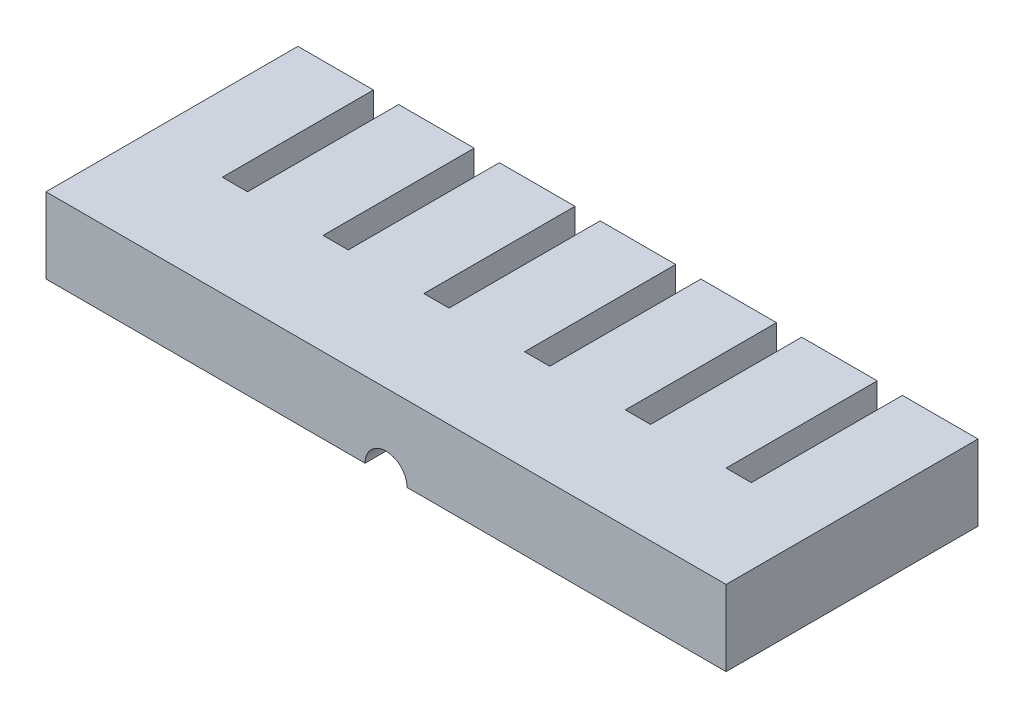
ISO-10303-21;
HEADER;
FILE_DESCRIPTION(('STEP AP214'),'2;1');
FILE_NAME('part.step','',(''),(''),'','','');
FILE_SCHEMA(('AUTOMOTIVE_DESIGN { 1 0 10303 214 1 1 1 1 }'));
ENDSEC;
DATA;
#1=APPLICATION_CONTEXT('core data for automotive mechanical design processes');
#2=APPLICATION_PROTOCOL_DEFINITION('international standard','automotive_design',2000,#1);
#3=PRODUCT_CONTEXT('',#1,'mechanical');
#4=PRODUCT('Part','Part','',(#3));
#5=PRODUCT_RELATED_PRODUCT_CATEGORY('part','',(#4));
#6=PRODUCT_DEFINITION_FORMATION('','',#4);
#7=PRODUCT_DEFINITION_CONTEXT('part definition',#1,'design');
#8=PRODUCT_DEFINITION('design','',#6,#7);
#9=PRODUCT_DEFINITION_SHAPE('','',#8);
#10=(LENGTH_UNIT() NAMED_UNIT(*) SI_UNIT(.MILLI.,.METRE.));
#11=(NAMED_UNIT(*) PLANE_ANGLE_UNIT() SI_UNIT($,.RADIAN.));
#12=(NAMED_UNIT(*) SI_UNIT($,.STERADIAN.) SOLID_ANGLE_UNIT());
#13=UNCERTAINTY_MEASURE_WITH_UNIT(LENGTH_MEASURE(1.E-05),#10,'distance_accuracy_value','');
#14=(GEOMETRIC_REPRESENTATION_CONTEXT(3) GLOBAL_UNCERTAINTY_ASSIGNED_CONTEXT((#13)) GLOBAL_UNIT_ASSIGNED_CONTEXT((#10,
#11,#12)) REPRESENTATION_CONTEXT('',''));
#15=CARTESIAN_POINT('',(0.,0.,0.));
#16=DIRECTION('',(0.,0.,1.));
#17=DIRECTION('',(1.,0.,0.));
#18=AXIS2_PLACEMENT_3D('',#15,#16,#17);
#19=CARTESIAN_POINT('',(0.,0.,0.));
#20=DIRECTION('',(0.,1.,0.));
#21=DIRECTION('',(0.,0.,1.));
#22=AXIS2_PLACEMENT_3D('',#19,#20,#21);
#23=PLANE('',#22);
#24=DIRECTION('',(1.,0.,0.));
#25=VECTOR('',#24,1.);
#26=CARTESIAN_POINT('',(62.,0.,-24.));
#27=LINE('',#26,#25);
#28=CARTESIAN_POINT('',(62.,0.,-24.));
#29=VERTEX_POINT('',#28);
#30=CARTESIAN_POINT('',(67.,0.,-24.));
#31=VERTEX_POINT('',#30);
#32=EDGE_CURVE('E870',#29,#31,#27,.T.);
#33=ORIENTED_EDGE('',*,*,#32,.F.);
#34=DIRECTION('',(0.,0.,-1.));
#35=VECTOR('',#34,1.);
#36=CARTESIAN_POINT('',(62.,0.,-6.));
#37=LINE('',#36,#35);
#38=CARTESIAN_POINT('',(62.,0.,-9.00000000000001));
#39=VERTEX_POINT('',#38);
#40=EDGE_CURVE('E871',#39,#29,#37,.T.);
#41=ORIENTED_EDGE('',*,*,#40,.F.);
#42=DIRECTION('',(1.,0.,0.));
#43=VECTOR('',#42,1.);
#44=CARTESIAN_POINT('',(2.,0.,-9.00000000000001));
#45=LINE('',#44,#43);
#46=CARTESIAN_POINT('',(55.,0.,-9.00000000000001));
#47=VERTEX_POINT('',#46);
#48=EDGE_CURVE('E859',#47,#39,#45,.T.);
#49=ORIENTED_EDGE('',*,*,#48,.F.);
#50=DIRECTION('',(0.,0.,1.));
#51=VECTOR('',#50,1.);
#52=CARTESIAN_POINT('',(55.,0.,-6.));
#53=LINE('',#52,#51);
#54=CARTESIAN_POINT('',(55.,0.,-24.));
#55=VERTEX_POINT('',#54);
#56=EDGE_CURVE('E860',#55,#47,#53,.T.);
#57=ORIENTED_EDGE('',*,*,#56,.F.);
#58=DIRECTION('',(1.,0.,0.));
#59=VECTOR('',#58,1.);
#60=CARTESIAN_POINT('',(50.,0.,-24.));
#61=LINE('',#60,#59);
#62=CARTESIAN_POINT('',(50.,0.,-24.));
#63=VERTEX_POINT('',#62);
#64=EDGE_CURVE('E856',#63,#55,#61,.T.);
#65=ORIENTED_EDGE('',*,*,#64,.F.);
#66=DIRECTION('',(0.,0.,-1.));
#67=VECTOR('',#66,1.);
#68=CARTESIAN_POINT('',(50.,0.,-6.));
#69=LINE('',#68,#67);
#70=CARTESIAN_POINT('',(50.,0.,-9.00000000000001));
#71=VERTEX_POINT('',#70);
#72=EDGE_CURVE('E857',#71,#63,#69,.T.);
#73=ORIENTED_EDGE('',*,*,#72,.F.);
#74=DIRECTION('',(1.,0.,0.));
#75=VECTOR('',#74,1.);
#76=CARTESIAN_POINT('',(2.,0.,-9.00000000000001));
#77=LINE('',#76,#75);
#78=CARTESIAN_POINT('',(43.,0.,-9.00000000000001));
#79=VERTEX_POINT('',#78);
#80=EDGE_CURVE('E846',#79,#71,#77,.T.);
#81=ORIENTED_EDGE('',*,*,#80,.F.);
#82=DIRECTION('',(0.,0.,1.));
#83=VECTOR('',#82,1.);
#84=CARTESIAN_POINT('',(43.,0.,-6.));
#85=LINE('',#84,#83);
#86=CARTESIAN_POINT('',(43.,0.,-24.));
#87=VERTEX_POINT('',#86);
#88=EDGE_CURVE('E847',#87,#79,#85,.T.);
#89=ORIENTED_EDGE('',*,*,#88,.F.);
#90=DIRECTION('',(1.,0.,0.));
#91=VECTOR('',#90,1.);
#92=CARTESIAN_POINT('',(38.,0.,-24.));
#93=LINE('',#92,#91);
#94=CARTESIAN_POINT('',(38.,0.,-24.));
#95=VERTEX_POINT('',#94);
#96=EDGE_CURVE('E843',#95,#87,#93,.T.);
#97=ORIENTED_EDGE('',*,*,#96,.F.);
#98=DIRECTION('',(0.,0.,-1.));
#99=VECTOR('',#98,1.);
#100=CARTESIAN_POINT('',(38.,0.,-6.));
#101=LINE('',#100,#99);
#102=CARTESIAN_POINT('',(38.,0.,-9.00000000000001));
#103=VERTEX_POINT('',#102);
#104=EDGE_CURVE('E844',#103,#95,#101,.T.);
#105=ORIENTED_EDGE('',*,*,#104,.F.);
#106=DIRECTION('',(1.,0.,0.));
#107=VECTOR('',#106,1.);
#108=CARTESIAN_POINT('',(2.,0.,-9.00000000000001));
#109=LINE('',#108,#107);
#110=CARTESIAN_POINT('',(31.,0.,-9.00000000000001));
#111=VERTEX_POINT('',#110);
#112=EDGE_CURVE('E836',#111,#103,#109,.T.);
#113=ORIENTED_EDGE('',*,*,#112,.F.);
#114=DIRECTION('',(0.,0.,1.));
#115=VECTOR('',#114,1.);
#116=CARTESIAN_POINT('',(31.,0.,-6.));
#117=LINE('',#116,#115);
#118=CARTESIAN_POINT('',(31.,0.,-24.));
#119=VERTEX_POINT('',#118);
#120=EDGE_CURVE('E837',#119,#111,#117,.T.);
#121=ORIENTED_EDGE('',*,*,#120,.F.);
#122=DIRECTION('',(1.,0.,0.));
#123=VECTOR('',#122,1.);
#124=CARTESIAN_POINT('',(26.,0.,-24.));
#125=LINE('',#124,#123);
#126=CARTESIAN_POINT('',(26.,0.,-24.));
#127=VERTEX_POINT('',#126);
#128=EDGE_CURVE('E833',#127,#119,#125,.T.);
#129=ORIENTED_EDGE('',*,*,#128,.F.);
#130=DIRECTION('',(0.,0.,-1.));
#131=VECTOR('',#130,1.);
#132=CARTESIAN_POINT('',(26.,0.,-6.));
#133=LINE('',#132,#131);
#134=CARTESIAN_POINT('',(26.,0.,-9.00000000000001));
#135=VERTEX_POINT('',#134);
#136=EDGE_CURVE('E834',#135,#127,#133,.T.);
#137=ORIENTED_EDGE('',*,*,#136,.F.);
#138=DIRECTION('',(1.,0.,0.));
#139=VECTOR('',#138,1.);
#140=CARTESIAN_POINT('',(2.,0.,-9.00000000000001));
#141=LINE('',#140,#139);
#142=CARTESIAN_POINT('',(19.,0.,-9.00000000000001));
#143=VERTEX_POINT('',#142);
#144=EDGE_CURVE('E825',#143,#135,#141,.T.);
#145=ORIENTED_EDGE('',*,*,#144,.F.);
#146=DIRECTION('',(0.,0.,1.));
#147=VECTOR('',#146,1.);
#148=CARTESIAN_POINT('',(19.,0.,-6.));
#149=LINE('',#148,#147);
#150=CARTESIAN_POINT('',(19.,0.,-24.));
#151=VERTEX_POINT('',#150);
#152=EDGE_CURVE('E826',#151,#143,#149,.T.);
#153=ORIENTED_EDGE('',*,*,#152,.F.);
#154=DIRECTION('',(1.,0.,0.));
#155=VECTOR('',#154,1.);
#156=CARTESIAN_POINT('',(14.,0.,-24.));
#157=LINE('',#156,#155);
#158=CARTESIAN_POINT('',(14.,0.,-24.));
#159=VERTEX_POINT('',#158);
#160=EDGE_CURVE('E822',#159,#151,#157,.T.);
#161=ORIENTED_EDGE('',*,*,#160,.F.);
#162=DIRECTION('',(0.,0.,-1.));
#163=VECTOR('',#162,1.);
#164=CARTESIAN_POINT('',(14.,0.,-6.));
#165=LINE('',#164,#163);
#166=CARTESIAN_POINT('',(14.,0.,-9.00000000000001));
#167=VERTEX_POINT('',#166);
#168=EDGE_CURVE('E823',#167,#159,#165,.T.);
#169=ORIENTED_EDGE('',*,*,#168,.F.);
#170=DIRECTION('',(1.,0.,0.));
#171=VECTOR('',#170,1.);
#172=CARTESIAN_POINT('',(2.,0.,-9.00000000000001));
#173=LINE('',#172,#171);
#174=CARTESIAN_POINT('',(6.99999999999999,0.,-9.00000000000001));
#175=VERTEX_POINT('',#174);
#176=EDGE_CURVE('E820',#175,#167,#173,.T.);
#177=ORIENTED_EDGE('',*,*,#176,.F.);
#178=DIRECTION('',(0.,0.,1.));
#179=VECTOR('',#178,1.);
#180=CARTESIAN_POINT('',(6.99999999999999,0.,-6.));
#181=LINE('',#180,#179);
#182=CARTESIAN_POINT('',(6.99999999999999,0.,-24.));
#183=VERTEX_POINT('',#182);
#184=EDGE_CURVE('E813',#183,#175,#181,.T.);
#185=ORIENTED_EDGE('',*,*,#184,.F.);
#186=DIRECTION('',(1.,0.,0.));
#187=VECTOR('',#186,1.);
#188=CARTESIAN_POINT('',(2.,0.,-24.));
#189=LINE('',#188,#187);
#190=CARTESIAN_POINT('',(2.,0.,-24.));
#191=VERTEX_POINT('',#190);
#192=EDGE_CURVE('E810',#191,#183,#189,.T.);
#193=ORIENTED_EDGE('',*,*,#192,.F.);
#194=DIRECTION('',(0.,0.,-1.));
#195=VECTOR('',#194,1.);
#196=CARTESIAN_POINT('',(2.,0.,-6.));
#197=LINE('',#196,#195);
#198=CARTESIAN_POINT('',(2.,0.,-6.));
#199=VERTEX_POINT('',#198);
#200=EDGE_CURVE('E811',#199,#191,#197,.T.);
#201=ORIENTED_EDGE('',*,*,#200,.F.);
#202=DIRECTION('',(-1.,0.,0.));
#203=VECTOR('',#202,1.);
#204=CARTESIAN_POINT('',(2.,0.,-6.));
#205=LINE('',#204,#203);
#206=CARTESIAN_POINT('',(38.,0.,-6.));
#207=VERTEX_POINT('',#206);
#208=EDGE_CURVE('E775',#207,#199,#205,.T.);
#209=ORIENTED_EDGE('',*,*,#208,.F.);
#210=DIRECTION('',(0.,0.,1.));
#211=VECTOR('',#210,1.);
#212=CARTESIAN_POINT('',(38.,0.,-9.));
#213=LINE('',#212,#211);
#214=CARTESIAN_POINT('',(38.,0.,0.));
#215=VERTEX_POINT('',#214);
#216=EDGE_CURVE('E43',#207,#215,#213,.T.);
#217=ORIENTED_EDGE('',*,*,#216,.T.);
#218=DIRECTION('',(1.,0.,0.));
#219=VECTOR('',#218,1.);
#220=CARTESIAN_POINT('',(0.,0.,0.));
#221=LINE('',#220,#219);
#222=CARTESIAN_POINT('',(0.,0.,0.));
#223=VERTEX_POINT('',#222);
#224=EDGE_CURVE('E801',#223,#215,#221,.T.);
#225=ORIENTED_EDGE('',*,*,#224,.F.);
#226=DIRECTION('',(0.,0.,1.));
#227=VECTOR('',#226,1.);
#228=CARTESIAN_POINT('',(0.,0.,0.));
#229=LINE('',#228,#227);
#230=CARTESIAN_POINT('',(0.,0.,-30.));
#231=VERTEX_POINT('',#230);
#232=EDGE_CURVE('E793',#231,#223,#229,.T.);
#233=ORIENTED_EDGE('',*,*,#232,.F.);
#234=DIRECTION('',(-1.,0.,0.));
#235=VECTOR('',#234,1.);
#236=CARTESIAN_POINT('',(0.,0.,-30.));
#237=LINE('',#236,#235);
#238=CARTESIAN_POINT('',(8.99999999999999,0.,-30.));
#239=VERTEX_POINT('',#238);
#240=EDGE_CURVE('E790',#239,#231,#237,.T.);
#241=ORIENTED_EDGE('',*,*,#240,.F.);
#242=DIRECTION('',(0.,0.,-1.));
#243=VECTOR('',#242,1.);
#244=CARTESIAN_POINT('',(8.99999999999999,0.,-30.));
#245=LINE('',#244,#243);
#246=CARTESIAN_POINT('',(9.,0.,-12.));
#247=VERTEX_POINT('',#246);
#248=EDGE_CURVE('E782',#247,#239,#245,.T.);
#249=ORIENTED_EDGE('',*,*,#248,.F.);
#250=DIRECTION('',(-1.,0.,0.));
#251=VECTOR('',#250,1.);
#252=CARTESIAN_POINT('',(9.,0.,-12.));
#253=LINE('',#252,#251);
#254=CARTESIAN_POINT('',(12.,0.,-12.));
#255=VERTEX_POINT('',#254);
#256=EDGE_CURVE('E783',#255,#247,#253,.T.);
#257=ORIENTED_EDGE('',*,*,#256,.F.);
#258=DIRECTION('',(0.,0.,1.));
#259=VECTOR('',#258,1.);
#260=CARTESIAN_POINT('',(12.,0.,-30.));
#261=LINE('',#260,#259);
#262=CARTESIAN_POINT('',(12.,0.,-30.));
#263=VERTEX_POINT('',#262);
#264=EDGE_CURVE('E780',#263,#255,#261,.T.);
#265=ORIENTED_EDGE('',*,*,#264,.F.);
#266=DIRECTION('',(-1.,0.,0.));
#267=VECTOR('',#266,1.);
#268=CARTESIAN_POINT('',(0.,0.,-30.));
#269=LINE('',#268,#267);
#270=CARTESIAN_POINT('',(21.,0.,-30.));
#271=VERTEX_POINT('',#270);
#272=EDGE_CURVE('E772',#271,#263,#269,.T.);
#273=ORIENTED_EDGE('',*,*,#272,.F.);
#274=DIRECTION('',(0.,0.,-1.));
#275=VECTOR('',#274,1.);
#276=CARTESIAN_POINT('',(21.,0.,-30.));
#277=LINE('',#276,#275);
#278=CARTESIAN_POINT('',(21.,0.,-12.));
#279=VERTEX_POINT('',#278);
#280=EDGE_CURVE('E767',#279,#271,#277,.T.);
#281=ORIENTED_EDGE('',*,*,#280,.F.);
#282=DIRECTION('',(-1.,0.,0.));
#283=VECTOR('',#282,1.);
#284=CARTESIAN_POINT('',(21.,0.,-12.));
#285=LINE('',#284,#283);
#286=CARTESIAN_POINT('',(24.,0.,-12.));
#287=VERTEX_POINT('',#286);
#288=EDGE_CURVE('E760',#287,#279,#285,.T.);
#289=ORIENTED_EDGE('',*,*,#288,.F.);
#290=DIRECTION('',(0.,0.,1.));
#291=VECTOR('',#290,1.);
#292=CARTESIAN_POINT('',(24.,0.,-30.));
#293=LINE('',#292,#291);
#294=CARTESIAN_POINT('',(24.,0.,-30.));
#295=VERTEX_POINT('',#294);
#296=EDGE_CURVE('E765',#295,#287,#293,.T.);
#297=ORIENTED_EDGE('',*,*,#296,.F.);
#298=DIRECTION('',(-1.,0.,0.));
#299=VECTOR('',#298,1.);
#300=CARTESIAN_POINT('',(0.,0.,-30.));
#301=LINE('',#300,#299);
#302=CARTESIAN_POINT('',(33.,0.,-30.));
#303=VERTEX_POINT('',#302);
#304=EDGE_CURVE('E770',#303,#295,#301,.T.);
#305=ORIENTED_EDGE('',*,*,#304,.F.);
#306=DIRECTION('',(0.,0.,-1.));
#307=VECTOR('',#306,1.);
#308=CARTESIAN_POINT('',(33.,0.,-30.));
#309=LINE('',#308,#307);
#310=CARTESIAN_POINT('',(33.,0.,-12.));
#311=VERTEX_POINT('',#310);
#312=EDGE_CURVE('E776',#311,#303,#309,.T.);
#313=ORIENTED_EDGE('',*,*,#312,.F.);
#314=DIRECTION('',(-1.,0.,0.));
#315=VECTOR('',#314,1.);
#316=CARTESIAN_POINT('',(33.,0.,-12.));
#317=LINE('',#316,#315);
#318=CARTESIAN_POINT('',(36.,0.,-12.));
#319=VERTEX_POINT('',#318);
#320=EDGE_CURVE('E769',#319,#311,#317,.T.);
#321=ORIENTED_EDGE('',*,*,#320,.F.);
#322=DIRECTION('',(0.,0.,1.));
#323=VECTOR('',#322,1.);
#324=CARTESIAN_POINT('',(36.,0.,-30.));
#325=LINE('',#324,#323);
#326=CARTESIAN_POINT('',(36.,0.,-30.));
#327=VERTEX_POINT('',#326);
#328=EDGE_CURVE('E779',#327,#319,#325,.T.);
#329=ORIENTED_EDGE('',*,*,#328,.F.);
#330=DIRECTION('',(-1.,0.,0.));
#331=VECTOR('',#330,1.);
#332=CARTESIAN_POINT('',(0.,0.,-30.));
#333=LINE('',#332,#331);
#334=CARTESIAN_POINT('',(45.,0.,-30.));
#335=VERTEX_POINT('',#334);
#336=EDGE_CURVE('E773',#335,#327,#333,.T.);
#337=ORIENTED_EDGE('',*,*,#336,.F.);
#338=DIRECTION('',(0.,0.,-1.));
#339=VECTOR('',#338,1.);
#340=CARTESIAN_POINT('',(45.,0.,-30.));
#341=LINE('',#340,#339);
#342=CARTESIAN_POINT('',(45.,0.,-12.));
#343=VERTEX_POINT('',#342);
#344=EDGE_CURVE('E796',#343,#335,#341,.T.);
#345=ORIENTED_EDGE('',*,*,#344,.F.);
#346=DIRECTION('',(-1.,0.,0.));
#347=VECTOR('',#346,1.);
#348=CARTESIAN_POINT('',(45.,0.,-12.));
#349=LINE('',#348,#347);
#350=CARTESIAN_POINT('',(48.,0.,-12.));
#351=VERTEX_POINT('',#350);
#352=EDGE_CURVE('E778',#351,#343,#349,.T.);
#353=ORIENTED_EDGE('',*,*,#352,.F.);
#354=DIRECTION('',(0.,0.,1.));
#355=VECTOR('',#354,1.);
#356=CARTESIAN_POINT('',(48.,0.,-30.));
#357=LINE('',#356,#355);
#358=CARTESIAN_POINT('',(48.,0.,-30.));
#359=VERTEX_POINT('',#358);
#360=EDGE_CURVE('E799',#359,#351,#357,.T.);
#361=ORIENTED_EDGE('',*,*,#360,.F.);
#362=DIRECTION('',(-1.,0.,0.));
#363=VECTOR('',#362,1.);
#364=CARTESIAN_POINT('',(0.,0.,-30.));
#365=LINE('',#364,#363);
#366=CARTESIAN_POINT('',(57.,0.,-30.));
#367=VERTEX_POINT('',#366);
#368=EDGE_CURVE('E795',#367,#359,#365,.T.);
#369=ORIENTED_EDGE('',*,*,#368,.F.);
#370=DIRECTION('',(0.,0.,-1.));
#371=VECTOR('',#370,1.);
#372=CARTESIAN_POINT('',(57.,0.,-30.));
#373=LINE('',#372,#371);
#374=CARTESIAN_POINT('',(57.,0.,-12.));
#375=VERTEX_POINT('',#374);
#376=EDGE_CURVE('E814',#375,#367,#373,.T.);
#377=ORIENTED_EDGE('',*,*,#376,.F.);
#378=DIRECTION('',(-1.,0.,0.));
#379=VECTOR('',#378,1.);
#380=CARTESIAN_POINT('',(57.,0.,-12.));
#381=LINE('',#380,#379);
#382=CARTESIAN_POINT('',(60.,0.,-12.));
#383=VERTEX_POINT('',#382);
#384=EDGE_CURVE('E798',#383,#375,#381,.T.);
#385=ORIENTED_EDGE('',*,*,#384,.F.);
#386=DIRECTION('',(0.,0.,1.));
#387=VECTOR('',#386,1.);
#388=CARTESIAN_POINT('',(60.,0.,-30.));
#389=LINE('',#388,#387);
#390=CARTESIAN_POINT('',(60.,0.,-30.));
#391=VERTEX_POINT('',#390);
#392=EDGE_CURVE('E817',#391,#383,#389,.T.);
#393=ORIENTED_EDGE('',*,*,#392,.F.);
#394=DIRECTION('',(-1.,0.,0.));
#395=VECTOR('',#394,1.);
#396=CARTESIAN_POINT('',(0.,0.,-30.));
#397=LINE('',#396,#395);
#398=CARTESIAN_POINT('',(69.,0.,-30.));
#399=VERTEX_POINT('',#398);
#400=EDGE_CURVE('E792',#399,#391,#397,.T.);
#401=ORIENTED_EDGE('',*,*,#400,.F.);
#402=DIRECTION('',(0.,0.,-1.));
#403=VECTOR('',#402,1.);
#404=CARTESIAN_POINT('',(69.,0.,-30.));
#405=LINE('',#404,#403);
#406=CARTESIAN_POINT('',(69.,0.,-12.));
#407=VERTEX_POINT('',#406);
#408=EDGE_CURVE('E787',#407,#399,#405,.T.);
#409=ORIENTED_EDGE('',*,*,#408,.F.);
#410=DIRECTION('',(-1.,0.,0.));
#411=VECTOR('',#410,1.);
#412=CARTESIAN_POINT('',(69.,0.,-12.));
#413=LINE('',#412,#411);
#414=CARTESIAN_POINT('',(72.,0.,-12.));
#415=VERTEX_POINT('',#414);
#416=EDGE_CURVE('E816',#415,#407,#413,.T.);
#417=ORIENTED_EDGE('',*,*,#416,.F.);
#418=DIRECTION('',(0.,0.,1.));
#419=VECTOR('',#418,1.);
#420=CARTESIAN_POINT('',(72.,0.,-30.));
#421=LINE('',#420,#419);
#422=CARTESIAN_POINT('',(72.,0.,-30.));
#423=VERTEX_POINT('',#422);
#424=EDGE_CURVE('E839',#423,#415,#421,.T.);
#425=ORIENTED_EDGE('',*,*,#424,.F.);
#426=DIRECTION('',(-1.,0.,0.));
#427=VECTOR('',#426,1.);
#428=CARTESIAN_POINT('',(0.,0.,-30.));
#429=LINE('',#428,#427);
#430=CARTESIAN_POINT('',(81.,0.,-30.));
#431=VERTEX_POINT('',#430);
#432=EDGE_CURVE('E789',#431,#423,#429,.T.);
#433=ORIENTED_EDGE('',*,*,#432,.F.);
#434=DIRECTION('',(0.,0.,-1.));
#435=VECTOR('',#434,1.);
#436=CARTESIAN_POINT('',(81.,0.,-30.));
#437=LINE('',#436,#435);
#438=CARTESIAN_POINT('',(81.,0.,0.));
#439=VERTEX_POINT('',#438);
#440=EDGE_CURVE('E851',#439,#431,#437,.T.);
#441=ORIENTED_EDGE('',*,*,#440,.F.);
#442=CARTESIAN_POINT('',(43.,0.,0.));
#443=VERTEX_POINT('',#442);
#444=EDGE_CURVE('E805',#443,#439,#221,.T.);
#445=ORIENTED_EDGE('',*,*,#444,.F.);
#446=DIRECTION('',(0.,0.,1.));
#447=VECTOR('',#446,1.);
#448=CARTESIAN_POINT('',(43.,0.,-9.));
#449=LINE('',#448,#447);
#450=CARTESIAN_POINT('',(43.,0.,-6.));
#451=VERTEX_POINT('',#450);
#452=EDGE_CURVE('E11',#443,#451,#449,.F.);
#453=ORIENTED_EDGE('',*,*,#452,.T.);
#454=CARTESIAN_POINT('',(79.,0.,-6.));
#455=VERTEX_POINT('',#454);
#456=EDGE_CURVE('E51',#455,#451,#205,.T.);
#457=ORIENTED_EDGE('',*,*,#456,.F.);
#458=DIRECTION('',(0.,0.,1.));
#459=VECTOR('',#458,1.);
#460=CARTESIAN_POINT('',(79.,0.,-6.));
#461=LINE('',#460,#459);
#462=CARTESIAN_POINT('',(79.,0.,-24.));
#463=VERTEX_POINT('',#462);
#464=EDGE_CURVE('E861',#463,#455,#461,.T.);
#465=ORIENTED_EDGE('',*,*,#464,.F.);
#466=DIRECTION('',(1.,0.,0.));
#467=VECTOR('',#466,1.);
#468=CARTESIAN_POINT('',(74.,0.,-24.));
#469=LINE('',#468,#467);
#470=CARTESIAN_POINT('',(74.,0.,-24.));
#471=VERTEX_POINT('',#470);
#472=EDGE_CURVE('E863',#471,#463,#469,.T.);
#473=ORIENTED_EDGE('',*,*,#472,.F.);
#474=DIRECTION('',(0.,0.,-1.));
#475=VECTOR('',#474,1.);
#476=CARTESIAN_POINT('',(74.,0.,-6.));
#477=LINE('',#476,#475);
#478=CARTESIAN_POINT('',(74.,0.,-9.00000000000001));
#479=VERTEX_POINT('',#478);
#480=EDGE_CURVE('E808',#479,#471,#477,.T.);
#481=ORIENTED_EDGE('',*,*,#480,.F.);
#482=DIRECTION('',(1.,0.,0.));
#483=VECTOR('',#482,1.);
#484=CARTESIAN_POINT('',(2.,0.,-9.00000000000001));
#485=LINE('',#484,#483);
#486=CARTESIAN_POINT('',(67.,0.,-9.00000000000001));
#487=VERTEX_POINT('',#486);
#488=EDGE_CURVE('E864',#487,#479,#485,.T.);
#489=ORIENTED_EDGE('',*,*,#488,.F.);
#490=DIRECTION('',(0.,0.,1.));
#491=VECTOR('',#490,1.);
#492=CARTESIAN_POINT('',(67.,0.,-6.));
#493=LINE('',#492,#491);
#494=EDGE_CURVE('E38',#31,#487,#493,.T.);
#495=ORIENTED_EDGE('',*,*,#494,.F.);
#496=EDGE_LOOP('',(#33,#41,#49,#57,#65,#73,#81,#89,#97,#105,#113,#121,#129,#137,#145,#153,#161,
#169,#177,#185,#193,#201,#209,#217,#225,#233,#241,#249,#257,#265,#273,#281,#289,#297,#305,#313,
#321,#329,#337,#345,#353,#361,#369,#377,#385,#393,#401,#409,#417,#425,#433,#441,#445,#453,#457,
#465,#473,#481,#489,#495));
#497=FACE_BOUND('',#496,.T.);
#498=ADVANCED_FACE('F35',(#497),#23,.F.);
#499=CARTESIAN_POINT('',(74.,-6.,-24.));
#500=DIRECTION('',(0.,0.,-1.));
#501=DIRECTION('',(-1.,0.,0.));
#502=AXIS2_PLACEMENT_3D('',#499,#500,#501);
#503=PLANE('',#502);
#504=DIRECTION('',(0.,1.,0.));
#505=VECTOR('',#504,1.);
#506=CARTESIAN_POINT('',(74.,-6.,-24.));
#507=LINE('',#506,#505);
#508=CARTESIAN_POINT('',(74.,6.,-24.));
#509=VERTEX_POINT('',#508);
#510=EDGE_CURVE('E578',#471,#509,#507,.T.);
#511=ORIENTED_EDGE('',*,*,#510,.F.);
#512=ORIENTED_EDGE('',*,*,#472,.T.);
#513=DIRECTION('',(0.,1.,0.));
#514=VECTOR('',#513,1.);
#515=CARTESIAN_POINT('',(79.,-6.,-24.));
#516=LINE('',#515,#514);
#517=CARTESIAN_POINT('',(79.,6.,-24.));
#518=VERTEX_POINT('',#517);
#519=EDGE_CURVE('E609',#463,#518,#516,.T.);
#520=ORIENTED_EDGE('',*,*,#519,.T.);
#521=DIRECTION('',(-1.,0.,0.));
#522=VECTOR('',#521,1.);
#523=CARTESIAN_POINT('',(74.,6.,-24.));
#524=LINE('',#523,#522);
#525=EDGE_CURVE('E604',#518,#509,#524,.T.);
#526=ORIENTED_EDGE('',*,*,#525,.T.);
#527=EDGE_LOOP('',(#511,#512,#520,#526));
#528=FACE_BOUND('',#527,.T.);
#529=ADVANCED_FACE('F1047',(#528),#503,.F.);
#530=CARTESIAN_POINT('',(2.,-3.,-9.00000000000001));
#531=DIRECTION('',(0.,0.,-1.));
#532=DIRECTION('',(-1.,0.,0.));
#533=AXIS2_PLACEMENT_3D('',#530,#531,#532);
#534=PLANE('',#533);
#535=DIRECTION('',(0.,1.,0.));
#536=VECTOR('',#535,1.);
#537=CARTESIAN_POINT('',(67.,-6.,-9.00000000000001));
#538=LINE('',#537,#536);
#539=CARTESIAN_POINT('',(67.,3.,-9.00000000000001));
#540=VERTEX_POINT('',#539);
#541=EDGE_CURVE('E883',#487,#540,#538,.T.);
#542=ORIENTED_EDGE('',*,*,#541,.F.);
#543=ORIENTED_EDGE('',*,*,#488,.T.);
#544=DIRECTION('',(0.,-1.,0.));
#545=VECTOR('',#544,1.);
#546=CARTESIAN_POINT('',(74.,-6.,-9.00000000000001));
#547=LINE('',#546,#545);
#548=CARTESIAN_POINT('',(74.,3.,-9.00000000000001));
#549=VERTEX_POINT('',#548);
#550=EDGE_CURVE('E895',#549,#479,#547,.T.);
#551=ORIENTED_EDGE('',*,*,#550,.F.);
#552=DIRECTION('',(-1.,0.,0.));
#553=VECTOR('',#552,1.);
#554=CARTESIAN_POINT('',(2.,3.,-9.00000000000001));
#555=LINE('',#554,#553);
#556=EDGE_CURVE('E893',#549,#540,#555,.T.);
#557=ORIENTED_EDGE('',*,*,#556,.T.);
#558=EDGE_LOOP('',(#542,#543,#551,#557));
#559=FACE_BOUND('',#558,.T.);
#560=ADVANCED_FACE('F892',(#559),#534,.F.);
#561=DIRECTION('',(0.,1.,0.));
#562=VECTOR('',#561,1.);
#563=CARTESIAN_POINT('',(55.,-6.,-9.00000000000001));
#564=LINE('',#563,#562);
#565=CARTESIAN_POINT('',(55.,3.,-9.00000000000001));
#566=VERTEX_POINT('',#565);
#567=EDGE_CURVE('E898',#47,#566,#564,.T.);
#568=ORIENTED_EDGE('',*,*,#567,.F.);
#569=ORIENTED_EDGE('',*,*,#48,.T.);
#570=DIRECTION('',(0.,-1.,0.));
#571=VECTOR('',#570,1.);
#572=CARTESIAN_POINT('',(62.,-6.,-9.00000000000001));
#573=LINE('',#572,#571);
#574=CARTESIAN_POINT('',(62.,3.,-9.00000000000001));
#575=VERTEX_POINT('',#574);
#576=EDGE_CURVE('E894',#575,#39,#573,.T.);
#577=ORIENTED_EDGE('',*,*,#576,.F.);
#578=EDGE_CURVE('E1366',#575,#566,#555,.T.);
#579=ORIENTED_EDGE('',*,*,#578,.T.);
#580=EDGE_LOOP('',(#568,#569,#577,#579));
#581=FACE_BOUND('',#580,.T.);
#582=ADVANCED_FACE('F1374',(#581),#534,.F.);
#583=DIRECTION('',(0.,1.,0.));
#584=VECTOR('',#583,1.);
#585=CARTESIAN_POINT('',(43.,-6.,-9.00000000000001));
#586=LINE('',#585,#584);
#587=CARTESIAN_POINT('',(43.,3.,-9.00000000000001));
#588=VERTEX_POINT('',#587);
#589=EDGE_CURVE('E907',#79,#588,#586,.T.);
#590=ORIENTED_EDGE('',*,*,#589,.F.);
#591=ORIENTED_EDGE('',*,*,#80,.T.);
#592=DIRECTION('',(0.,-1.,0.));
#593=VECTOR('',#592,1.);
#594=CARTESIAN_POINT('',(50.,-6.,-9.00000000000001));
#595=LINE('',#594,#593);
#596=CARTESIAN_POINT('',(50.,3.,-9.00000000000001));
#597=VERTEX_POINT('',#596);
#598=EDGE_CURVE('E904',#597,#71,#595,.T.);
#599=ORIENTED_EDGE('',*,*,#598,.F.);
#600=EDGE_CURVE('E1364',#597,#588,#555,.T.);
#601=ORIENTED_EDGE('',*,*,#600,.T.);
#602=EDGE_LOOP('',(#590,#591,#599,#601));
#603=FACE_BOUND('',#602,.T.);
#604=ADVANCED_FACE('F1379',(#603),#534,.F.);
#605=DIRECTION('',(0.,1.,0.));
#606=VECTOR('',#605,1.);
#607=CARTESIAN_POINT('',(31.,-6.,-9.00000000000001));
#608=LINE('',#607,#606);
#609=CARTESIAN_POINT('',(31.,3.,-9.00000000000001));
#610=VERTEX_POINT('',#609);
#611=EDGE_CURVE('E912',#111,#610,#608,.T.);
#612=ORIENTED_EDGE('',*,*,#611,.F.);
#613=ORIENTED_EDGE('',*,*,#112,.T.);
#614=DIRECTION('',(0.,-1.,0.));
#615=VECTOR('',#614,1.);
#616=CARTESIAN_POINT('',(38.,-6.,-9.00000000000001));
#617=LINE('',#616,#615);
#618=CARTESIAN_POINT('',(38.,3.,-9.00000000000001));
#619=VERTEX_POINT('',#618);
#620=EDGE_CURVE('E909',#619,#103,#617,.T.);
#621=ORIENTED_EDGE('',*,*,#620,.F.);
#622=EDGE_CURVE('E1354',#619,#610,#555,.T.);
#623=ORIENTED_EDGE('',*,*,#622,.T.);
#624=EDGE_LOOP('',(#612,#613,#621,#623));
#625=FACE_BOUND('',#624,.T.);
#626=ADVANCED_FACE('F1363',(#625),#534,.F.);
#627=DIRECTION('',(0.,1.,0.));
#628=VECTOR('',#627,1.);
#629=CARTESIAN_POINT('',(19.,-6.,-9.00000000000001));
#630=LINE('',#629,#628);
#631=CARTESIAN_POINT('',(19.,3.,-9.00000000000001));
#632=VERTEX_POINT('',#631);
#633=EDGE_CURVE('E917',#143,#632,#630,.T.);
#634=ORIENTED_EDGE('',*,*,#633,.F.);
#635=ORIENTED_EDGE('',*,*,#144,.T.);
#636=DIRECTION('',(0.,-1.,0.));
#637=VECTOR('',#636,1.);
#638=CARTESIAN_POINT('',(26.,-6.,-9.00000000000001));
#639=LINE('',#638,#637);
#640=CARTESIAN_POINT('',(26.,3.,-9.00000000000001));
#641=VERTEX_POINT('',#640);
#642=EDGE_CURVE('E914',#641,#135,#639,.T.);
#643=ORIENTED_EDGE('',*,*,#642,.F.);
#644=EDGE_CURVE('E1090',#641,#632,#555,.T.);
#645=ORIENTED_EDGE('',*,*,#644,.T.);
#646=EDGE_LOOP('',(#634,#635,#643,#645));
#647=FACE_BOUND('',#646,.T.);
#648=ADVANCED_FACE('F1306',(#647),#534,.F.);
#649=DIRECTION('',(0.,1.,0.));
#650=VECTOR('',#649,1.);
#651=CARTESIAN_POINT('',(6.99999999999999,-6.,-9.00000000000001));
#652=LINE('',#651,#650);
#653=CARTESIAN_POINT('',(6.99999999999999,3.,-9.00000000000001));
#654=VERTEX_POINT('',#653);
#655=EDGE_CURVE('E598',#175,#654,#652,.T.);
#656=ORIENTED_EDGE('',*,*,#655,.F.);
#657=ORIENTED_EDGE('',*,*,#176,.T.);
#658=DIRECTION('',(0.,-1.,0.));
#659=VECTOR('',#658,1.);
#660=CARTESIAN_POINT('',(14.,-6.,-9.00000000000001));
#661=LINE('',#660,#659);
#662=CARTESIAN_POINT('',(14.,3.,-9.00000000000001));
#663=VERTEX_POINT('',#662);
#664=EDGE_CURVE('E919',#663,#167,#661,.T.);
#665=ORIENTED_EDGE('',*,*,#664,.F.);
#666=EDGE_CURVE('E481',#663,#654,#555,.T.);
#667=ORIENTED_EDGE('',*,*,#666,.T.);
#668=EDGE_LOOP('',(#656,#657,#665,#667));
#669=FACE_BOUND('',#668,.T.);
#670=ADVANCED_FACE('F1216',(#669),#534,.F.);
#671=CARTESIAN_POINT('',(72.,6.,0.));
#672=DIRECTION('',(0.,-1.,0.));
#673=DIRECTION('',(0.,0.,-1.));
#674=AXIS2_PLACEMENT_3D('',#671,#672,#673);
#675=PLANE('',#674);
#676=DIRECTION('',(0.,0.,1.));
#677=VECTOR('',#676,1.);
#678=CARTESIAN_POINT('',(74.,6.,-6.));
#679=LINE('',#678,#677);
#680=CARTESIAN_POINT('',(74.,6.,-6.));
#681=VERTEX_POINT('',#680);
#682=EDGE_CURVE('E594',#509,#681,#679,.T.);
#683=ORIENTED_EDGE('',*,*,#682,.F.);
#684=ORIENTED_EDGE('',*,*,#525,.F.);
#685=DIRECTION('',(0.,0.,-1.));
#686=VECTOR('',#685,1.);
#687=CARTESIAN_POINT('',(79.,6.,-6.));
#688=LINE('',#687,#686);
#689=CARTESIAN_POINT('',(79.,6.,-6.));
#690=VERTEX_POINT('',#689);
#691=EDGE_CURVE('E601',#690,#518,#688,.T.);
#692=ORIENTED_EDGE('',*,*,#691,.F.);
#693=DIRECTION('',(1.,0.,0.));
#694=VECTOR('',#693,1.);
#695=CARTESIAN_POINT('',(74.,6.,-6.));
#696=LINE('',#695,#694);
#697=EDGE_CURVE('E597',#681,#690,#696,.T.);
#698=ORIENTED_EDGE('',*,*,#697,.F.);
#699=EDGE_LOOP('',(#683,#684,#692,#698));
#700=FACE_BOUND('',#699,.T.);
#701=ADVANCED_FACE('F1044',(#700),#675,.T.);
#702=CARTESIAN_POINT('',(74.,-6.,-6.));
#703=DIRECTION('',(-1.,0.,0.));
#704=DIRECTION('',(0.,0.,1.));
#705=AXIS2_PLACEMENT_3D('',#702,#703,#704);
#706=PLANE('',#705);
#707=ORIENTED_EDGE('',*,*,#550,.T.);
#708=ORIENTED_EDGE('',*,*,#480,.T.);
#709=ORIENTED_EDGE('',*,*,#510,.T.);
#710=ORIENTED_EDGE('',*,*,#682,.T.);
#711=DIRECTION('',(0.,1.,0.));
#712=VECTOR('',#711,1.);
#713=CARTESIAN_POINT('',(74.,-6.,-6.));
#714=LINE('',#713,#712);
#715=CARTESIAN_POINT('',(74.,3.,-6.));
#716=VERTEX_POINT('',#715);
#717=EDGE_CURVE('E607',#716,#681,#714,.T.);
#718=ORIENTED_EDGE('',*,*,#717,.F.);
#719=DIRECTION('',(0.,0.,-1.));
#720=VECTOR('',#719,1.);
#721=CARTESIAN_POINT('',(74.,3.,-6.));
#722=LINE('',#721,#720);
#723=EDGE_CURVE('E1039',#716,#549,#722,.T.);
#724=ORIENTED_EDGE('',*,*,#723,.T.);
#725=EDGE_LOOP('',(#707,#708,#709,#710,#718,#724));
#726=FACE_BOUND('',#725,.T.);
#727=ADVANCED_FACE('F1038',(#726),#706,.F.);
#728=CARTESIAN_POINT('',(0.,3.,0.));
#729=DIRECTION('',(0.,1.,0.));
#730=DIRECTION('',(0.,0.,1.));
#731=AXIS2_PLACEMENT_3D('',#728,#729,#730);
#732=PLANE('',#731);
#733=ORIENTED_EDGE('',*,*,#556,.F.);
#734=ORIENTED_EDGE('',*,*,#723,.F.);
#735=DIRECTION('',(1.,0.,0.));
#736=VECTOR('',#735,1.);
#737=CARTESIAN_POINT('',(2.,3.,-6.));
#738=LINE('',#737,#736);
#739=CARTESIAN_POINT('',(67.,3.,-6.));
#740=VERTEX_POINT('',#739);
#741=EDGE_CURVE('E498',#740,#716,#738,.T.);
#742=ORIENTED_EDGE('',*,*,#741,.F.);
#743=DIRECTION('',(0.,0.,1.));
#744=VECTOR('',#743,1.);
#745=CARTESIAN_POINT('',(67.,3.,-6.));
#746=LINE('',#745,#744);
#747=EDGE_CURVE('E1087',#540,#740,#746,.T.);
#748=ORIENTED_EDGE('',*,*,#747,.F.);
#749=EDGE_LOOP('',(#733,#734,#742,#748));
#750=FACE_BOUND('',#749,.T.);
#751=ADVANCED_FACE('F1211',(#750),#732,.F.);
#752=CARTESIAN_POINT('',(67.,-6.,-6.));
#753=DIRECTION('',(1.,0.,0.));
#754=DIRECTION('',(0.,0.,-1.));
#755=AXIS2_PLACEMENT_3D('',#752,#753,#754);
#756=PLANE('',#755);
#757=DIRECTION('',(0.,1.,0.));
#758=VECTOR('',#757,1.);
#759=CARTESIAN_POINT('',(67.,-6.,-24.));
#760=LINE('',#759,#758);
#761=CARTESIAN_POINT('',(67.,6.,-24.));
#762=VERTEX_POINT('',#761);
#763=EDGE_CURVE('E589',#31,#762,#760,.T.);
#764=ORIENTED_EDGE('',*,*,#763,.F.);
#765=ORIENTED_EDGE('',*,*,#494,.T.);
#766=ORIENTED_EDGE('',*,*,#541,.T.);
#767=ORIENTED_EDGE('',*,*,#747,.T.);
#768=DIRECTION('',(0.,1.,0.));
#769=VECTOR('',#768,1.);
#770=CARTESIAN_POINT('',(67.,-6.,-6.));
#771=LINE('',#770,#769);
#772=CARTESIAN_POINT('',(67.,6.,-6.));
#773=VERTEX_POINT('',#772);
#774=EDGE_CURVE('E591',#740,#773,#771,.T.);
#775=ORIENTED_EDGE('',*,*,#774,.T.);
#776=DIRECTION('',(0.,0.,-1.));
#777=VECTOR('',#776,1.);
#778=CARTESIAN_POINT('',(67.,6.,-6.));
#779=LINE('',#778,#777);
#780=EDGE_CURVE('E581',#773,#762,#779,.T.);
#781=ORIENTED_EDGE('',*,*,#780,.T.);
#782=EDGE_LOOP('',(#764,#765,#766,#767,#775,#781));
#783=FACE_BOUND('',#782,.T.);
#784=ADVANCED_FACE('F880',(#783),#756,.F.);
#785=CARTESIAN_POINT('',(60.,6.,0.));
#786=DIRECTION('',(0.,-1.,0.));
#787=DIRECTION('',(0.,0.,-1.));
#788=AXIS2_PLACEMENT_3D('',#785,#786,#787);
#789=PLANE('',#788);
#790=DIRECTION('',(0.,0.,1.));
#791=VECTOR('',#790,1.);
#792=CARTESIAN_POINT('',(62.,6.,-6.));
#793=LINE('',#792,#791);
#794=CARTESIAN_POINT('',(62.,6.,-24.));
#795=VERTEX_POINT('',#794);
#796=CARTESIAN_POINT('',(62.,6.,-6.));
#797=VERTEX_POINT('',#796);
#798=EDGE_CURVE('E574',#795,#797,#793,.T.);
#799=ORIENTED_EDGE('',*,*,#798,.F.);
#800=DIRECTION('',(-1.,0.,0.));
#801=VECTOR('',#800,1.);
#802=CARTESIAN_POINT('',(62.,6.,-24.));
#803=LINE('',#802,#801);
#804=EDGE_CURVE('E584',#762,#795,#803,.T.);
#805=ORIENTED_EDGE('',*,*,#804,.F.);
#806=ORIENTED_EDGE('',*,*,#780,.F.);
#807=DIRECTION('',(1.,0.,0.));
#808=VECTOR('',#807,1.);
#809=CARTESIAN_POINT('',(62.,6.,-6.));
#810=LINE('',#809,#808);
#811=EDGE_CURVE('E577',#797,#773,#810,.T.);
#812=ORIENTED_EDGE('',*,*,#811,.F.);
#813=EDGE_LOOP('',(#799,#805,#806,#812));
#814=FACE_BOUND('',#813,.T.);
#815=ADVANCED_FACE('F1028',(#814),#789,.T.);
#816=CARTESIAN_POINT('',(62.,-6.,-6.));
#817=DIRECTION('',(-1.,0.,0.));
#818=DIRECTION('',(0.,0.,1.));
#819=AXIS2_PLACEMENT_3D('',#816,#817,#818);
#820=PLANE('',#819);
#821=ORIENTED_EDGE('',*,*,#576,.T.);
#822=ORIENTED_EDGE('',*,*,#40,.T.);
#823=DIRECTION('',(0.,1.,0.));
#824=VECTOR('',#823,1.);
#825=CARTESIAN_POINT('',(62.,-6.,-24.));
#826=LINE('',#825,#824);
#827=EDGE_CURVE('E558',#29,#795,#826,.T.);
#828=ORIENTED_EDGE('',*,*,#827,.T.);
#829=ORIENTED_EDGE('',*,*,#798,.T.);
#830=DIRECTION('',(0.,1.,0.));
#831=VECTOR('',#830,1.);
#832=CARTESIAN_POINT('',(62.,-6.,-6.));
#833=LINE('',#832,#831);
#834=CARTESIAN_POINT('',(62.,3.,-6.));
#835=VERTEX_POINT('',#834);
#836=EDGE_CURVE('E587',#835,#797,#833,.T.);
#837=ORIENTED_EDGE('',*,*,#836,.F.);
#838=DIRECTION('',(0.,0.,-1.));
#839=VECTOR('',#838,1.);
#840=CARTESIAN_POINT('',(62.,3.,-6.));
#841=LINE('',#840,#839);
#842=EDGE_CURVE('E1024',#835,#575,#841,.T.);
#843=ORIENTED_EDGE('',*,*,#842,.T.);
#844=EDGE_LOOP('',(#821,#822,#828,#829,#837,#843));
#845=FACE_BOUND('',#844,.T.);
#846=ADVANCED_FACE('F1023',(#845),#820,.F.);
#847=ORIENTED_EDGE('',*,*,#578,.F.);
#848=ORIENTED_EDGE('',*,*,#842,.F.);
#849=CARTESIAN_POINT('',(55.,3.,-6.));
#850=VERTEX_POINT('',#849);
#851=EDGE_CURVE('E996',#850,#835,#738,.T.);
#852=ORIENTED_EDGE('',*,*,#851,.F.);
#853=DIRECTION('',(0.,0.,1.));
#854=VECTOR('',#853,1.);
#855=CARTESIAN_POINT('',(55.,3.,-6.));
#856=LINE('',#855,#854);
#857=EDGE_CURVE('E1084',#566,#850,#856,.T.);
#858=ORIENTED_EDGE('',*,*,#857,.F.);
#859=EDGE_LOOP('',(#847,#848,#852,#858));
#860=FACE_BOUND('',#859,.T.);
#861=ADVANCED_FACE('F1214',(#860),#732,.F.);
#862=CARTESIAN_POINT('',(55.,-6.,-6.));
#863=DIRECTION('',(1.,0.,0.));
#864=DIRECTION('',(0.,0.,-1.));
#865=AXIS2_PLACEMENT_3D('',#862,#863,#864);
#866=PLANE('',#865);
#867=DIRECTION('',(0.,1.,0.));
#868=VECTOR('',#867,1.);
#869=CARTESIAN_POINT('',(55.,-6.,-24.));
#870=LINE('',#869,#868);
#871=CARTESIAN_POINT('',(55.,6.,-24.));
#872=VERTEX_POINT('',#871);
#873=EDGE_CURVE('E569',#55,#872,#870,.T.);
#874=ORIENTED_EDGE('',*,*,#873,.F.);
#875=ORIENTED_EDGE('',*,*,#56,.T.);
#876=ORIENTED_EDGE('',*,*,#567,.T.);
#877=ORIENTED_EDGE('',*,*,#857,.T.);
#878=DIRECTION('',(0.,1.,0.));
#879=VECTOR('',#878,1.);
#880=CARTESIAN_POINT('',(55.,-6.,-6.));
#881=LINE('',#880,#879);
#882=CARTESIAN_POINT('',(55.,6.,-6.));
#883=VERTEX_POINT('',#882);
#884=EDGE_CURVE('E571',#850,#883,#881,.T.);
#885=ORIENTED_EDGE('',*,*,#884,.T.);
#886=DIRECTION('',(0.,0.,-1.));
#887=VECTOR('',#886,1.);
#888=CARTESIAN_POINT('',(55.,6.,-6.));
#889=LINE('',#888,#887);
#890=EDGE_CURVE('E561',#883,#872,#889,.T.);
#891=ORIENTED_EDGE('',*,*,#890,.T.);
#892=EDGE_LOOP('',(#874,#875,#876,#877,#885,#891));
#893=FACE_BOUND('',#892,.T.);
#894=ADVANCED_FACE('F1013',(#893),#866,.F.);
#895=CARTESIAN_POINT('',(48.,6.,0.));
#896=DIRECTION('',(0.,-1.,0.));
#897=DIRECTION('',(0.,0.,-1.));
#898=AXIS2_PLACEMENT_3D('',#895,#896,#897);
#899=PLANE('',#898);
#900=DIRECTION('',(0.,0.,1.));
#901=VECTOR('',#900,1.);
#902=CARTESIAN_POINT('',(50.,6.,-6.));
#903=LINE('',#902,#901);
#904=CARTESIAN_POINT('',(50.,6.,-24.));
#905=VERTEX_POINT('',#904);
#906=CARTESIAN_POINT('',(50.,6.,-6.));
#907=VERTEX_POINT('',#906);
#908=EDGE_CURVE('E554',#905,#907,#903,.T.);
#909=ORIENTED_EDGE('',*,*,#908,.F.);
#910=DIRECTION('',(-1.,0.,0.));
#911=VECTOR('',#910,1.);
#912=CARTESIAN_POINT('',(50.,6.,-24.));
#913=LINE('',#912,#911);
#914=EDGE_CURVE('E564',#872,#905,#913,.T.);
#915=ORIENTED_EDGE('',*,*,#914,.F.);
#916=ORIENTED_EDGE('',*,*,#890,.F.);
#917=DIRECTION('',(1.,0.,0.));
#918=VECTOR('',#917,1.);
#919=CARTESIAN_POINT('',(50.,6.,-6.));
#920=LINE('',#919,#918);
#921=EDGE_CURVE('E557',#907,#883,#920,.T.);
#922=ORIENTED_EDGE('',*,*,#921,.F.);
#923=EDGE_LOOP('',(#909,#915,#916,#922));
#924=FACE_BOUND('',#923,.T.);
#925=ADVANCED_FACE('F1005',(#924),#899,.T.);
#926=CARTESIAN_POINT('',(50.,-6.,-6.));
#927=DIRECTION('',(-1.,0.,0.));
#928=DIRECTION('',(0.,0.,1.));
#929=AXIS2_PLACEMENT_3D('',#926,#927,#928);
#930=PLANE('',#929);
#931=ORIENTED_EDGE('',*,*,#598,.T.);
#932=ORIENTED_EDGE('',*,*,#72,.T.);
#933=DIRECTION('',(0.,1.,0.));
#934=VECTOR('',#933,1.);
#935=CARTESIAN_POINT('',(50.,-6.,-24.));
#936=LINE('',#935,#934);
#937=EDGE_CURVE('E538',#63,#905,#936,.T.);
#938=ORIENTED_EDGE('',*,*,#937,.T.);
#939=ORIENTED_EDGE('',*,*,#908,.T.);
#940=DIRECTION('',(0.,1.,0.));
#941=VECTOR('',#940,1.);
#942=CARTESIAN_POINT('',(50.,-6.,-6.));
#943=LINE('',#942,#941);
#944=CARTESIAN_POINT('',(50.,3.,-6.));
#945=VERTEX_POINT('',#944);
#946=EDGE_CURVE('E567',#945,#907,#943,.T.);
#947=ORIENTED_EDGE('',*,*,#946,.F.);
#948=DIRECTION('',(0.,0.,-1.));
#949=VECTOR('',#948,1.);
#950=CARTESIAN_POINT('',(50.,3.,-6.));
#951=LINE('',#950,#949);
#952=EDGE_CURVE('E1000',#945,#597,#951,.T.);
#953=ORIENTED_EDGE('',*,*,#952,.T.);
#954=EDGE_LOOP('',(#931,#932,#938,#939,#947,#953));
#955=FACE_BOUND('',#954,.T.);
#956=ADVANCED_FACE('F999',(#955),#930,.F.);
#957=ORIENTED_EDGE('',*,*,#600,.F.);
#958=ORIENTED_EDGE('',*,*,#952,.F.);
#959=CARTESIAN_POINT('',(43.,3.,-6.));
#960=VERTEX_POINT('',#959);
#961=EDGE_CURVE('E971',#960,#945,#738,.T.);
#962=ORIENTED_EDGE('',*,*,#961,.F.);
#963=DIRECTION('',(0.,0.,1.));
#964=VECTOR('',#963,1.);
#965=CARTESIAN_POINT('',(43.,3.,-6.));
#966=LINE('',#965,#964);
#967=EDGE_CURVE('E1081',#588,#960,#966,.T.);
#968=ORIENTED_EDGE('',*,*,#967,.F.);
#969=EDGE_LOOP('',(#957,#958,#962,#968));
#970=FACE_BOUND('',#969,.T.);
#971=ADVANCED_FACE('F1331',(#970),#732,.F.);
#972=CARTESIAN_POINT('',(43.,-6.,-6.));
#973=DIRECTION('',(1.,0.,0.));
#974=DIRECTION('',(0.,0.,-1.));
#975=AXIS2_PLACEMENT_3D('',#972,#973,#974);
#976=PLANE('',#975);
#977=DIRECTION('',(0.,1.,0.));
#978=VECTOR('',#977,1.);
#979=CARTESIAN_POINT('',(43.,-6.,-24.));
#980=LINE('',#979,#978);
#981=CARTESIAN_POINT('',(43.,6.,-24.));
#982=VERTEX_POINT('',#981);
#983=EDGE_CURVE('E549',#87,#982,#980,.T.);
#984=ORIENTED_EDGE('',*,*,#983,.F.);
#985=ORIENTED_EDGE('',*,*,#88,.T.);
#986=ORIENTED_EDGE('',*,*,#589,.T.);
#987=ORIENTED_EDGE('',*,*,#967,.T.);
#988=DIRECTION('',(0.,1.,0.));
#989=VECTOR('',#988,1.);
#990=CARTESIAN_POINT('',(43.,-6.,-6.));
#991=LINE('',#990,#989);
#992=CARTESIAN_POINT('',(43.,6.,-6.));
#993=VERTEX_POINT('',#992);
#994=EDGE_CURVE('E551',#960,#993,#991,.T.);
#995=ORIENTED_EDGE('',*,*,#994,.T.);
#996=DIRECTION('',(0.,0.,-1.));
#997=VECTOR('',#996,1.);
#998=CARTESIAN_POINT('',(43.,6.,-6.));
#999=LINE('',#998,#997);
#1000=EDGE_CURVE('E541',#993,#982,#999,.T.);
#1001=ORIENTED_EDGE('',*,*,#1000,.T.);
#1002=EDGE_LOOP('',(#984,#985,#986,#987,#995,#1001));
#1003=FACE_BOUND('',#1002,.T.);
#1004=ADVANCED_FACE('F988',(#1003),#976,.F.);
#1005=CARTESIAN_POINT('',(36.,6.,0.));
#1006=DIRECTION('',(0.,-1.,0.));
#1007=DIRECTION('',(0.,0.,-1.));
#1008=AXIS2_PLACEMENT_3D('',#1005,#1006,#1007);
#1009=PLANE('',#1008);
#1010=DIRECTION('',(0.,0.,1.));
#1011=VECTOR('',#1010,1.);
#1012=CARTESIAN_POINT('',(38.,6.,-6.));
#1013=LINE('',#1012,#1011);
#1014=CARTESIAN_POINT('',(38.,6.,-24.));
#1015=VERTEX_POINT('',#1014);
#1016=CARTESIAN_POINT('',(38.,6.,-6.));
#1017=VERTEX_POINT('',#1016);
#1018=EDGE_CURVE('E534',#1015,#1017,#1013,.T.);
#1019=ORIENTED_EDGE('',*,*,#1018,.F.);
#1020=DIRECTION('',(-1.,0.,0.));
#1021=VECTOR('',#1020,1.);
#1022=CARTESIAN_POINT('',(38.,6.,-24.));
#1023=LINE('',#1022,#1021);
#1024=EDGE_CURVE('E544',#982,#1015,#1023,.T.);
#1025=ORIENTED_EDGE('',*,*,#1024,.F.);
#1026=ORIENTED_EDGE('',*,*,#1000,.F.);
#1027=DIRECTION('',(1.,0.,0.));
#1028=VECTOR('',#1027,1.);
#1029=CARTESIAN_POINT('',(38.,6.,-6.));
#1030=LINE('',#1029,#1028);
#1031=EDGE_CURVE('E537',#1017,#993,#1030,.T.);
#1032=ORIENTED_EDGE('',*,*,#1031,.F.);
#1033=EDGE_LOOP('',(#1019,#1025,#1026,#1032));
#1034=FACE_BOUND('',#1033,.T.);
#1035=ADVANCED_FACE('F980',(#1034),#1009,.T.);
#1036=CARTESIAN_POINT('',(38.,-6.,-6.));
#1037=DIRECTION('',(-1.,0.,0.));
#1038=DIRECTION('',(0.,0.,1.));
#1039=AXIS2_PLACEMENT_3D('',#1036,#1037,#1038);
#1040=PLANE('',#1039);
#1041=ORIENTED_EDGE('',*,*,#620,.T.);
#1042=ORIENTED_EDGE('',*,*,#104,.T.);
#1043=DIRECTION('',(0.,1.,0.));
#1044=VECTOR('',#1043,1.);
#1045=CARTESIAN_POINT('',(38.,-6.,-24.));
#1046=LINE('',#1045,#1044);
#1047=EDGE_CURVE('E517',#95,#1015,#1046,.T.);
#1048=ORIENTED_EDGE('',*,*,#1047,.T.);
#1049=ORIENTED_EDGE('',*,*,#1018,.T.);
#1050=DIRECTION('',(0.,1.,0.));
#1051=VECTOR('',#1050,1.);
#1052=CARTESIAN_POINT('',(38.,-6.,-6.));
#1053=LINE('',#1052,#1051);
#1054=CARTESIAN_POINT('',(38.,3.,-6.));
#1055=VERTEX_POINT('',#1054);
#1056=EDGE_CURVE('E547',#1055,#1017,#1053,.T.);
#1057=ORIENTED_EDGE('',*,*,#1056,.F.);
#1058=DIRECTION('',(0.,0.,-1.));
#1059=VECTOR('',#1058,1.);
#1060=CARTESIAN_POINT('',(38.,3.,-6.));
#1061=LINE('',#1060,#1059);
#1062=EDGE_CURVE('E975',#1055,#619,#1061,.T.);
#1063=ORIENTED_EDGE('',*,*,#1062,.T.);
#1064=EDGE_LOOP('',(#1041,#1042,#1048,#1049,#1057,#1063));
#1065=FACE_BOUND('',#1064,.T.);
#1066=ADVANCED_FACE('F974',(#1065),#1040,.F.);
#1067=ORIENTED_EDGE('',*,*,#622,.F.);
#1068=ORIENTED_EDGE('',*,*,#1062,.F.);
#1069=CARTESIAN_POINT('',(31.,3.,-6.));
#1070=VERTEX_POINT('',#1069);
#1071=EDGE_CURVE('E946',#1070,#1055,#738,.T.);
#1072=ORIENTED_EDGE('',*,*,#1071,.F.);
#1073=DIRECTION('',(0.,0.,1.));
#1074=VECTOR('',#1073,1.);
#1075=CARTESIAN_POINT('',(31.,3.,-6.));
#1076=LINE('',#1075,#1074);
#1077=EDGE_CURVE('E1078',#610,#1070,#1076,.T.);
#1078=ORIENTED_EDGE('',*,*,#1077,.F.);
#1079=EDGE_LOOP('',(#1067,#1068,#1072,#1078));
#1080=FACE_BOUND('',#1079,.T.);
#1081=ADVANCED_FACE('F1322',(#1080),#732,.F.);
#1082=CARTESIAN_POINT('',(31.,-6.,-6.));
#1083=DIRECTION('',(1.,0.,0.));
#1084=DIRECTION('',(0.,0.,-1.));
#1085=AXIS2_PLACEMENT_3D('',#1082,#1083,#1084);
#1086=PLANE('',#1085);
#1087=DIRECTION('',(0.,1.,0.));
#1088=VECTOR('',#1087,1.);
#1089=CARTESIAN_POINT('',(31.,-6.,-24.));
#1090=LINE('',#1089,#1088);
#1091=CARTESIAN_POINT('',(31.,6.,-24.));
#1092=VERTEX_POINT('',#1091);
#1093=EDGE_CURVE('E529',#119,#1092,#1090,.T.);
#1094=ORIENTED_EDGE('',*,*,#1093,.F.);
#1095=ORIENTED_EDGE('',*,*,#120,.T.);
#1096=ORIENTED_EDGE('',*,*,#611,.T.);
#1097=ORIENTED_EDGE('',*,*,#1077,.T.);
#1098=DIRECTION('',(0.,1.,0.));
#1099=VECTOR('',#1098,1.);
#1100=CARTESIAN_POINT('',(31.,-6.,-6.));
#1101=LINE('',#1100,#1099);
#1102=CARTESIAN_POINT('',(31.,6.,-6.));
#1103=VERTEX_POINT('',#1102);
#1104=EDGE_CURVE('E531',#1070,#1103,#1101,.T.);
#1105=ORIENTED_EDGE('',*,*,#1104,.T.);
#1106=DIRECTION('',(0.,0.,-1.));
#1107=VECTOR('',#1106,1.);
#1108=CARTESIAN_POINT('',(31.,6.,-6.));
#1109=LINE('',#1108,#1107);
#1110=EDGE_CURVE('E520',#1103,#1092,#1109,.T.);
#1111=ORIENTED_EDGE('',*,*,#1110,.T.);
#1112=EDGE_LOOP('',(#1094,#1095,#1096,#1097,#1105,#1111));
#1113=FACE_BOUND('',#1112,.T.);
#1114=ADVANCED_FACE('F963',(#1113),#1086,.F.);
#1115=CARTESIAN_POINT('',(24.,6.,0.));
#1116=DIRECTION('',(0.,-1.,0.));
#1117=DIRECTION('',(0.,0.,-1.));
#1118=AXIS2_PLACEMENT_3D('',#1115,#1116,#1117);
#1119=PLANE('',#1118);
#1120=DIRECTION('',(0.,0.,1.));
#1121=VECTOR('',#1120,1.);
#1122=CARTESIAN_POINT('',(26.,6.,-6.));
#1123=LINE('',#1122,#1121);
#1124=CARTESIAN_POINT('',(26.,6.,-24.));
#1125=VERTEX_POINT('',#1124);
#1126=CARTESIAN_POINT('',(26.,6.,-6.));
#1127=VERTEX_POINT('',#1126);
#1128=EDGE_CURVE('E513',#1125,#1127,#1123,.T.);
#1129=ORIENTED_EDGE('',*,*,#1128,.F.);
#1130=DIRECTION('',(-1.,0.,0.));
#1131=VECTOR('',#1130,1.);
#1132=CARTESIAN_POINT('',(26.,6.,-24.));
#1133=LINE('',#1132,#1131);
#1134=EDGE_CURVE('E523',#1092,#1125,#1133,.T.);
#1135=ORIENTED_EDGE('',*,*,#1134,.F.);
#1136=ORIENTED_EDGE('',*,*,#1110,.F.);
#1137=DIRECTION('',(1.,0.,0.));
#1138=VECTOR('',#1137,1.);
#1139=CARTESIAN_POINT('',(26.,6.,-6.));
#1140=LINE('',#1139,#1138);
#1141=EDGE_CURVE('E516',#1127,#1103,#1140,.T.);
#1142=ORIENTED_EDGE('',*,*,#1141,.F.);
#1143=EDGE_LOOP('',(#1129,#1135,#1136,#1142));
#1144=FACE_BOUND('',#1143,.T.);
#1145=ADVANCED_FACE('F955',(#1144),#1119,.T.);
#1146=CARTESIAN_POINT('',(26.,-6.,-6.));
#1147=DIRECTION('',(-1.,0.,0.));
#1148=DIRECTION('',(0.,0.,1.));
#1149=AXIS2_PLACEMENT_3D('',#1146,#1147,#1148);
#1150=PLANE('',#1149);
#1151=ORIENTED_EDGE('',*,*,#642,.T.);
#1152=ORIENTED_EDGE('',*,*,#136,.T.);
#1153=DIRECTION('',(0.,1.,0.));
#1154=VECTOR('',#1153,1.);
#1155=CARTESIAN_POINT('',(26.,-6.,-24.));
#1156=LINE('',#1155,#1154);
#1157=EDGE_CURVE('E527',#127,#1125,#1156,.T.);
#1158=ORIENTED_EDGE('',*,*,#1157,.T.);
#1159=ORIENTED_EDGE('',*,*,#1128,.T.);
#1160=DIRECTION('',(0.,1.,0.));
#1161=VECTOR('',#1160,1.);
#1162=CARTESIAN_POINT('',(26.,-6.,-6.));
#1163=LINE('',#1162,#1161);
#1164=CARTESIAN_POINT('',(26.,3.,-6.));
#1165=VERTEX_POINT('',#1164);
#1166=EDGE_CURVE('E526',#1165,#1127,#1163,.T.);
#1167=ORIENTED_EDGE('',*,*,#1166,.F.);
#1168=DIRECTION('',(0.,0.,-1.));
#1169=VECTOR('',#1168,1.);
#1170=CARTESIAN_POINT('',(26.,3.,-6.));
#1171=LINE('',#1170,#1169);
#1172=EDGE_CURVE('E950',#1165,#641,#1171,.T.);
#1173=ORIENTED_EDGE('',*,*,#1172,.T.);
#1174=EDGE_LOOP('',(#1151,#1152,#1158,#1159,#1167,#1173));
#1175=FACE_BOUND('',#1174,.T.);
#1176=ADVANCED_FACE('F949',(#1175),#1150,.F.);
#1177=ORIENTED_EDGE('',*,*,#644,.F.);
#1178=ORIENTED_EDGE('',*,*,#1172,.F.);
#1179=CARTESIAN_POINT('',(19.,3.,-6.));
#1180=VERTEX_POINT('',#1179);
#1181=EDGE_CURVE('E496',#1180,#1165,#738,.T.);
#1182=ORIENTED_EDGE('',*,*,#1181,.F.);
#1183=DIRECTION('',(0.,0.,1.));
#1184=VECTOR('',#1183,1.);
#1185=CARTESIAN_POINT('',(19.,3.,-6.));
#1186=LINE('',#1185,#1184);
#1187=EDGE_CURVE('E487',#632,#1180,#1186,.T.);
#1188=ORIENTED_EDGE('',*,*,#1187,.F.);
#1189=EDGE_LOOP('',(#1177,#1178,#1182,#1188));
#1190=FACE_BOUND('',#1189,.T.);
#1191=ADVANCED_FACE('F1303',(#1190),#732,.F.);
#1192=CARTESIAN_POINT('',(19.,-6.,-6.));
#1193=DIRECTION('',(1.,0.,0.));
#1194=DIRECTION('',(0.,0.,-1.));
#1195=AXIS2_PLACEMENT_3D('',#1192,#1193,#1194);
#1196=PLANE('',#1195);
#1197=DIRECTION('',(0.,1.,0.));
#1198=VECTOR('',#1197,1.);
#1199=CARTESIAN_POINT('',(19.,-6.,-24.));
#1200=LINE('',#1199,#1198);
#1201=CARTESIAN_POINT('',(19.,6.,-24.));
#1202=VERTEX_POINT('',#1201);
#1203=EDGE_CURVE('E506',#151,#1202,#1200,.T.);
#1204=ORIENTED_EDGE('',*,*,#1203,.F.);
#1205=ORIENTED_EDGE('',*,*,#152,.T.);
#1206=ORIENTED_EDGE('',*,*,#633,.T.);
#1207=ORIENTED_EDGE('',*,*,#1187,.T.);
#1208=DIRECTION('',(0.,1.,0.));
#1209=VECTOR('',#1208,1.);
#1210=CARTESIAN_POINT('',(19.,-6.,-6.));
#1211=LINE('',#1210,#1209);
#1212=CARTESIAN_POINT('',(19.,6.,-6.));
#1213=VERTEX_POINT('',#1212);
#1214=EDGE_CURVE('E503',#1180,#1213,#1211,.T.);
#1215=ORIENTED_EDGE('',*,*,#1214,.T.);
#1216=DIRECTION('',(0.,0.,-1.));
#1217=VECTOR('',#1216,1.);
#1218=CARTESIAN_POINT('',(19.,6.,-6.));
#1219=LINE('',#1218,#1217);
#1220=EDGE_CURVE('E509',#1213,#1202,#1219,.T.);
#1221=ORIENTED_EDGE('',*,*,#1220,.T.);
#1222=EDGE_LOOP('',(#1204,#1205,#1206,#1207,#1215,#1221));
#1223=FACE_BOUND('',#1222,.T.);
#1224=ADVANCED_FACE('F936',(#1223),#1196,.F.);
#1225=CARTESIAN_POINT('',(12.,6.,0.));
#1226=DIRECTION('',(0.,-1.,0.));
#1227=DIRECTION('',(0.,0.,-1.));
#1228=AXIS2_PLACEMENT_3D('',#1225,#1226,#1227);
#1229=PLANE('',#1228);
#1230=DIRECTION('',(0.,0.,1.));
#1231=VECTOR('',#1230,1.);
#1232=CARTESIAN_POINT('',(14.,6.,-6.));
#1233=LINE('',#1232,#1231);
#1234=CARTESIAN_POINT('',(14.,6.,-24.));
#1235=VERTEX_POINT('',#1234);
#1236=CARTESIAN_POINT('',(14.,6.,-6.));
#1237=VERTEX_POINT('',#1236);
#1238=EDGE_CURVE('E502',#1235,#1237,#1233,.T.);
#1239=ORIENTED_EDGE('',*,*,#1238,.F.);
#1240=DIRECTION('',(-1.,0.,0.));
#1241=VECTOR('',#1240,1.);
#1242=CARTESIAN_POINT('',(14.,6.,-24.));
#1243=LINE('',#1242,#1241);
#1244=EDGE_CURVE('E504',#1202,#1235,#1243,.T.);
#1245=ORIENTED_EDGE('',*,*,#1244,.F.);
#1246=ORIENTED_EDGE('',*,*,#1220,.F.);
#1247=DIRECTION('',(1.,0.,0.));
#1248=VECTOR('',#1247,1.);
#1249=CARTESIAN_POINT('',(14.,6.,-6.));
#1250=LINE('',#1249,#1248);
#1251=EDGE_CURVE('E923',#1237,#1213,#1250,.T.);
#1252=ORIENTED_EDGE('',*,*,#1251,.F.);
#1253=EDGE_LOOP('',(#1239,#1245,#1246,#1252));
#1254=FACE_BOUND('',#1253,.T.);
#1255=ADVANCED_FACE('F940',(#1254),#1229,.T.);
#1256=CARTESIAN_POINT('',(14.,-6.,-6.));
#1257=DIRECTION('',(-1.,0.,0.));
#1258=DIRECTION('',(0.,0.,1.));
#1259=AXIS2_PLACEMENT_3D('',#1256,#1257,#1258);
#1260=PLANE('',#1259);
#1261=ORIENTED_EDGE('',*,*,#664,.T.);
#1262=ORIENTED_EDGE('',*,*,#168,.T.);
#1263=DIRECTION('',(0.,1.,0.));
#1264=VECTOR('',#1263,1.);
#1265=CARTESIAN_POINT('',(14.,-6.,-24.));
#1266=LINE('',#1265,#1264);
#1267=EDGE_CURVE('E688',#159,#1235,#1266,.T.);
#1268=ORIENTED_EDGE('',*,*,#1267,.T.);
#1269=ORIENTED_EDGE('',*,*,#1238,.T.);
#1270=DIRECTION('',(0.,1.,0.));
#1271=VECTOR('',#1270,1.);
#1272=CARTESIAN_POINT('',(14.,-6.,-6.));
#1273=LINE('',#1272,#1271);
#1274=CARTESIAN_POINT('',(14.,3.,-6.));
#1275=VERTEX_POINT('',#1274);
#1276=EDGE_CURVE('E492',#1275,#1237,#1273,.T.);
#1277=ORIENTED_EDGE('',*,*,#1276,.F.);
#1278=DIRECTION('',(0.,0.,-1.));
#1279=VECTOR('',#1278,1.);
#1280=CARTESIAN_POINT('',(14.,3.,-6.));
#1281=LINE('',#1280,#1279);
#1282=EDGE_CURVE('E474',#1275,#663,#1281,.T.);
#1283=ORIENTED_EDGE('',*,*,#1282,.T.);
#1284=EDGE_LOOP('',(#1261,#1262,#1268,#1269,#1277,#1283));
#1285=FACE_BOUND('',#1284,.T.);
#1286=ADVANCED_FACE('F500',(#1285),#1260,.F.);
#1287=ORIENTED_EDGE('',*,*,#666,.F.);
#1288=ORIENTED_EDGE('',*,*,#1282,.F.);
#1289=CARTESIAN_POINT('',(6.99999999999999,3.,-6.));
#1290=VERTEX_POINT('',#1289);
#1291=EDGE_CURVE('E478',#1290,#1275,#738,.T.);
#1292=ORIENTED_EDGE('',*,*,#1291,.F.);
#1293=DIRECTION('',(0.,0.,1.));
#1294=VECTOR('',#1293,1.);
#1295=CARTESIAN_POINT('',(6.99999999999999,3.,-6.));
#1296=LINE('',#1295,#1294);
#1297=EDGE_CURVE('E486',#654,#1290,#1296,.T.);
#1298=ORIENTED_EDGE('',*,*,#1297,.F.);
#1299=EDGE_LOOP('',(#1287,#1288,#1292,#1298));
#1300=FACE_BOUND('',#1299,.T.);
#1301=ADVANCED_FACE('F476',(#1300),#732,.F.);
#1302=CARTESIAN_POINT('',(6.99999999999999,-6.,-6.));
#1303=DIRECTION('',(1.,0.,0.));
#1304=DIRECTION('',(0.,0.,-1.));
#1305=AXIS2_PLACEMENT_3D('',#1302,#1303,#1304);
#1306=PLANE('',#1305);
#1307=DIRECTION('',(0.,1.,0.));
#1308=VECTOR('',#1307,1.);
#1309=CARTESIAN_POINT('',(6.99999999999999,-6.,-24.));
#1310=LINE('',#1309,#1308);
#1311=CARTESIAN_POINT('',(6.99999999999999,6.,-24.));
#1312=VERTEX_POINT('',#1311);
#1313=EDGE_CURVE('E715',#183,#1312,#1310,.T.);
#1314=ORIENTED_EDGE('',*,*,#1313,.F.);
#1315=ORIENTED_EDGE('',*,*,#184,.T.);
#1316=ORIENTED_EDGE('',*,*,#655,.T.);
#1317=ORIENTED_EDGE('',*,*,#1297,.T.);
#1318=DIRECTION('',(0.,1.,0.));
#1319=VECTOR('',#1318,1.);
#1320=CARTESIAN_POINT('',(6.99999999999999,-6.,-6.));
#1321=LINE('',#1320,#1319);
#1322=CARTESIAN_POINT('',(6.99999999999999,6.,-6.));
#1323=VERTEX_POINT('',#1322);
#1324=EDGE_CURVE('E495',#1290,#1323,#1321,.T.);
#1325=ORIENTED_EDGE('',*,*,#1324,.T.);
#1326=DIRECTION('',(0.,0.,-1.));
#1327=VECTOR('',#1326,1.);
#1328=CARTESIAN_POINT('',(6.99999999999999,6.,-6.));
#1329=LINE('',#1328,#1327);
#1330=EDGE_CURVE('E705',#1323,#1312,#1329,.T.);
#1331=ORIENTED_EDGE('',*,*,#1330,.T.);
#1332=EDGE_LOOP('',(#1314,#1315,#1316,#1317,#1325,#1331));
#1333=FACE_BOUND('',#1332,.T.);
#1334=ADVANCED_FACE('F1073',(#1333),#1306,.F.);
#1335=CARTESIAN_POINT('',(0.,6.,0.));
#1336=DIRECTION('',(0.,-1.,0.));
#1337=DIRECTION('',(0.,0.,-1.));
#1338=AXIS2_PLACEMENT_3D('',#1335,#1336,#1337);
#1339=PLANE('',#1338);
#1340=DIRECTION('',(0.,0.,1.));
#1341=VECTOR('',#1340,1.);
#1342=CARTESIAN_POINT('',(2.,6.,-6.));
#1343=LINE('',#1342,#1341);
#1344=CARTESIAN_POINT('',(2.,6.,-24.));
#1345=VERTEX_POINT('',#1344);
#1346=CARTESIAN_POINT('',(2.,6.,-6.));
#1347=VERTEX_POINT('',#1346);
#1348=EDGE_CURVE('E627',#1345,#1347,#1343,.T.);
#1349=ORIENTED_EDGE('',*,*,#1348,.F.);
#1350=DIRECTION('',(-1.,0.,0.));
#1351=VECTOR('',#1350,1.);
#1352=CARTESIAN_POINT('',(2.,6.,-24.));
#1353=LINE('',#1352,#1351);
#1354=EDGE_CURVE('E708',#1312,#1345,#1353,.T.);
#1355=ORIENTED_EDGE('',*,*,#1354,.F.);
#1356=ORIENTED_EDGE('',*,*,#1330,.F.);
#1357=DIRECTION('',(1.,0.,0.));
#1358=VECTOR('',#1357,1.);
#1359=CARTESIAN_POINT('',(2.,6.,-6.));
#1360=LINE('',#1359,#1358);
#1361=EDGE_CURVE('E703',#1347,#1323,#1360,.T.);
#1362=ORIENTED_EDGE('',*,*,#1361,.F.);
#1363=EDGE_LOOP('',(#1349,#1355,#1356,#1362));
#1364=FACE_BOUND('',#1363,.T.);
#1365=ADVANCED_FACE('F1067',(#1364),#1339,.T.);
#1366=CARTESIAN_POINT('',(2.,-6.,-6.));
#1367=DIRECTION('',(-1.,0.,0.));
#1368=DIRECTION('',(0.,0.,1.));
#1369=AXIS2_PLACEMENT_3D('',#1366,#1367,#1368);
#1370=PLANE('',#1369);
#1371=DIRECTION('',(0.,1.,0.));
#1372=VECTOR('',#1371,1.);
#1373=CARTESIAN_POINT('',(2.,-6.,-6.));
#1374=LINE('',#1373,#1372);
#1375=EDGE_CURVE('E711',#199,#1347,#1374,.T.);
#1376=ORIENTED_EDGE('',*,*,#1375,.F.);
#1377=ORIENTED_EDGE('',*,*,#200,.T.);
#1378=DIRECTION('',(0.,1.,0.));
#1379=VECTOR('',#1378,1.);
#1380=CARTESIAN_POINT('',(2.,-6.,-24.));
#1381=LINE('',#1380,#1379);
#1382=EDGE_CURVE('E712',#191,#1345,#1381,.T.);
#1383=ORIENTED_EDGE('',*,*,#1382,.T.);
#1384=ORIENTED_EDGE('',*,*,#1348,.T.);
#1385=EDGE_LOOP('',(#1376,#1377,#1383,#1384));
#1386=FACE_BOUND('',#1385,.T.);
#1387=ADVANCED_FACE('F1063',(#1386),#1370,.F.);
#1388=CARTESIAN_POINT('',(79.,-6.,-6.));
#1389=DIRECTION('',(1.,0.,0.));
#1390=DIRECTION('',(0.,0.,-1.));
#1391=AXIS2_PLACEMENT_3D('',#1388,#1389,#1390);
#1392=PLANE('',#1391);
#1393=ORIENTED_EDGE('',*,*,#519,.F.);
#1394=ORIENTED_EDGE('',*,*,#464,.T.);
#1395=DIRECTION('',(0.,1.,0.));
#1396=VECTOR('',#1395,1.);
#1397=CARTESIAN_POINT('',(79.,-6.,-6.));
#1398=LINE('',#1397,#1396);
#1399=EDGE_CURVE('E611',#455,#690,#1398,.T.);
#1400=ORIENTED_EDGE('',*,*,#1399,.T.);
#1401=ORIENTED_EDGE('',*,*,#691,.T.);
#1402=EDGE_LOOP('',(#1393,#1394,#1400,#1401));
#1403=FACE_BOUND('',#1402,.T.);
#1404=ADVANCED_FACE('F1051',(#1403),#1392,.F.);
#1405=CARTESIAN_POINT('',(2.,-6.,-6.));
#1406=DIRECTION('',(0.,0.,1.));
#1407=DIRECTION('',(1.,0.,0.));
#1408=AXIS2_PLACEMENT_3D('',#1405,#1406,#1407);
#1409=PLANE('',#1408);
#1410=ORIENTED_EDGE('',*,*,#1399,.F.);
#1411=ORIENTED_EDGE('',*,*,#456,.T.);
#1412=CARTESIAN_POINT('',(40.5,0.,-6.));
#1413=DIRECTION('',(0.,0.,1.));
#1414=DIRECTION('',(1.,0.,0.));
#1415=AXIS2_PLACEMENT_3D('',#1412,#1413,#1414);
#1416=CIRCLE('',#1415,2.5);
#1417=EDGE_CURVE('E761',#207,#451,#1416,.F.);
#1418=ORIENTED_EDGE('',*,*,#1417,.F.);
#1419=ORIENTED_EDGE('',*,*,#208,.T.);
#1420=ORIENTED_EDGE('',*,*,#1375,.T.);
#1421=ORIENTED_EDGE('',*,*,#1361,.T.);
#1422=ORIENTED_EDGE('',*,*,#1324,.F.);
#1423=ORIENTED_EDGE('',*,*,#1291,.T.);
#1424=ORIENTED_EDGE('',*,*,#1276,.T.);
#1425=ORIENTED_EDGE('',*,*,#1251,.T.);
#1426=ORIENTED_EDGE('',*,*,#1214,.F.);
#1427=ORIENTED_EDGE('',*,*,#1181,.T.);
#1428=ORIENTED_EDGE('',*,*,#1166,.T.);
#1429=ORIENTED_EDGE('',*,*,#1141,.T.);
#1430=ORIENTED_EDGE('',*,*,#1104,.F.);
#1431=ORIENTED_EDGE('',*,*,#1071,.T.);
#1432=ORIENTED_EDGE('',*,*,#1056,.T.);
#1433=ORIENTED_EDGE('',*,*,#1031,.T.);
#1434=ORIENTED_EDGE('',*,*,#994,.F.);
#1435=ORIENTED_EDGE('',*,*,#961,.T.);
#1436=ORIENTED_EDGE('',*,*,#946,.T.);
#1437=ORIENTED_EDGE('',*,*,#921,.T.);
#1438=ORIENTED_EDGE('',*,*,#884,.F.);
#1439=ORIENTED_EDGE('',*,*,#851,.T.);
#1440=ORIENTED_EDGE('',*,*,#836,.T.);
#1441=ORIENTED_EDGE('',*,*,#811,.T.);
#1442=ORIENTED_EDGE('',*,*,#774,.F.);
#1443=ORIENTED_EDGE('',*,*,#741,.T.);
#1444=ORIENTED_EDGE('',*,*,#717,.T.);
#1445=ORIENTED_EDGE('',*,*,#697,.T.);
#1446=EDGE_LOOP('',(#1410,#1411,#1418,#1419,#1420,#1421,#1422,#1423,#1424,#1425,#1426,#1427,
#1428,#1429,#1430,#1431,#1432,#1433,#1434,#1435,#1436,#1437,#1438,#1439,#1440,#1441,#1442,#1443,
#1444,#1445));
#1447=FACE_BOUND('',#1446,.T.);
#1448=ADVANCED_FACE('F490',(#1447),#1409,.F.);
#1449=CARTESIAN_POINT('',(40.5,0.,-9.));
#1450=DIRECTION('',(0.,0.,1.));
#1451=DIRECTION('',(1.,0.,0.));
#1452=AXIS2_PLACEMENT_3D('',#1449,#1450,#1451);
#1453=CYLINDRICAL_SURFACE('',#1452,2.5);
#1454=ORIENTED_EDGE('',*,*,#216,.F.);
#1455=ORIENTED_EDGE('',*,*,#1417,.T.);
#1456=ORIENTED_EDGE('',*,*,#452,.F.);
#1457=CARTESIAN_POINT('',(40.5,0.,0.));
#1458=DIRECTION('',(0.,0.,-1.));
#1459=DIRECTION('',(-1.,0.,0.));
#1460=AXIS2_PLACEMENT_3D('',#1457,#1458,#1459);
#1461=CIRCLE('',#1460,2.5);
#1462=EDGE_CURVE('E763',#215,#443,#1461,.T.);
#1463=ORIENTED_EDGE('',*,*,#1462,.F.);
#1464=EDGE_LOOP('',(#1454,#1455,#1456,#1463));
#1465=FACE_BOUND('',#1464,.T.);
#1466=ADVANCED_FACE('F1055',(#1465),#1453,.F.);
#1467=CARTESIAN_POINT('',(0.,9.,0.));
#1468=DIRECTION('',(1.,0.,0.));
#1469=DIRECTION('',(0.,0.,-1.));
#1470=AXIS2_PLACEMENT_3D('',#1467,#1468,#1469);
#1471=PLANE('',#1470);
#1472=DIRECTION('',(0.,-1.,0.));
#1473=VECTOR('',#1472,1.);
#1474=CARTESIAN_POINT('',(0.,9.,-30.));
#1475=LINE('',#1474,#1473);
#1476=CARTESIAN_POINT('',(0.,9.,-30.));
#1477=VERTEX_POINT('',#1476);
#1478=EDGE_CURVE('E746',#1477,#231,#1475,.T.);
#1479=ORIENTED_EDGE('',*,*,#1478,.T.);
#1480=ORIENTED_EDGE('',*,*,#232,.T.);
#1481=DIRECTION('',(0.,-1.,0.));
#1482=VECTOR('',#1481,1.);
#1483=CARTESIAN_POINT('',(0.,9.,0.));
#1484=LINE('',#1483,#1482);
#1485=CARTESIAN_POINT('',(0.,9.,0.));
#1486=VERTEX_POINT('',#1485);
#1487=EDGE_CURVE('E757',#1486,#223,#1484,.T.);
#1488=ORIENTED_EDGE('',*,*,#1487,.F.);
#1489=DIRECTION('',(0.,0.,1.));
#1490=VECTOR('',#1489,1.);
#1491=CARTESIAN_POINT('',(0.,9.,0.));
#1492=LINE('',#1491,#1490);
#1493=EDGE_CURVE('E730',#1477,#1486,#1492,.T.);
#1494=ORIENTED_EDGE('',*,*,#1493,.F.);
#1495=EDGE_LOOP('',(#1479,#1480,#1488,#1494));
#1496=FACE_BOUND('',#1495,.T.);
#1497=ADVANCED_FACE('F1104',(#1496),#1471,.F.);
#1498=CARTESIAN_POINT('',(0.,9.,0.));
#1499=DIRECTION('',(0.,0.,-1.));
#1500=DIRECTION('',(-1.,0.,0.));
#1501=AXIS2_PLACEMENT_3D('',#1498,#1499,#1500);
#1502=PLANE('',#1501);
#1503=ORIENTED_EDGE('',*,*,#1487,.T.);
#1504=ORIENTED_EDGE('',*,*,#224,.T.);
#1505=ORIENTED_EDGE('',*,*,#1462,.T.);
#1506=ORIENTED_EDGE('',*,*,#444,.T.);
#1507=DIRECTION('',(0.,-1.,0.));
#1508=VECTOR('',#1507,1.);
#1509=CARTESIAN_POINT('',(81.,9.,0.));
#1510=LINE('',#1509,#1508);
#1511=CARTESIAN_POINT('',(81.,9.,0.));
#1512=VERTEX_POINT('',#1511);
#1513=EDGE_CURVE('E754',#1512,#439,#1510,.T.);
#1514=ORIENTED_EDGE('',*,*,#1513,.F.);
#1515=DIRECTION('',(1.,0.,0.));
#1516=VECTOR('',#1515,1.);
#1517=CARTESIAN_POINT('',(0.,9.,0.));
#1518=LINE('',#1517,#1516);
#1519=EDGE_CURVE('E738',#1486,#1512,#1518,.T.);
#1520=ORIENTED_EDGE('',*,*,#1519,.F.);
#1521=EDGE_LOOP('',(#1503,#1504,#1505,#1506,#1514,#1520));
#1522=FACE_BOUND('',#1521,.T.);
#1523=ADVANCED_FACE('F1093',(#1522),#1502,.F.);
#1524=CARTESIAN_POINT('',(81.,9.,-30.));
#1525=DIRECTION('',(-1.,0.,0.));
#1526=DIRECTION('',(0.,0.,1.));
#1527=AXIS2_PLACEMENT_3D('',#1524,#1525,#1526);
#1528=PLANE('',#1527);
#1529=ORIENTED_EDGE('',*,*,#1513,.T.);
#1530=ORIENTED_EDGE('',*,*,#440,.T.);
#1531=DIRECTION('',(0.,-1.,0.));
#1532=VECTOR('',#1531,1.);
#1533=CARTESIAN_POINT('',(81.,9.,-30.));
#1534=LINE('',#1533,#1532);
#1535=CARTESIAN_POINT('',(81.,9.,-30.));
#1536=VERTEX_POINT('',#1535);
#1537=EDGE_CURVE('E751',#1536,#431,#1534,.T.);
#1538=ORIENTED_EDGE('',*,*,#1537,.F.);
#1539=DIRECTION('',(0.,0.,-1.));
#1540=VECTOR('',#1539,1.);
#1541=CARTESIAN_POINT('',(81.,9.,-30.));
#1542=LINE('',#1541,#1540);
#1543=EDGE_CURVE('E740',#1512,#1536,#1542,.T.);
#1544=ORIENTED_EDGE('',*,*,#1543,.F.);
#1545=EDGE_LOOP('',(#1529,#1530,#1538,#1544));
#1546=FACE_BOUND('',#1545,.T.);
#1547=ADVANCED_FACE('F1288',(#1546),#1528,.F.);
#1548=CARTESIAN_POINT('',(0.,9.,-30.));
#1549=DIRECTION('',(0.,0.,1.));
#1550=DIRECTION('',(1.,0.,0.));
#1551=AXIS2_PLACEMENT_3D('',#1548,#1549,#1550);
#1552=PLANE('',#1551);
#1553=DIRECTION('',(0.,1.,0.));
#1554=VECTOR('',#1553,1.);
#1555=CARTESIAN_POINT('',(8.99999999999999,-9.,-30.));
#1556=LINE('',#1555,#1554);
#1557=CARTESIAN_POINT('',(8.99999999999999,9.,-30.));
#1558=VERTEX_POINT('',#1557);
#1559=EDGE_CURVE('E728',#239,#1558,#1556,.T.);
#1560=ORIENTED_EDGE('',*,*,#1559,.F.);
#1561=ORIENTED_EDGE('',*,*,#240,.T.);
#1562=ORIENTED_EDGE('',*,*,#1478,.F.);
#1563=DIRECTION('',(-1.,0.,0.));
#1564=VECTOR('',#1563,1.);
#1565=CARTESIAN_POINT('',(0.,9.,-30.));
#1566=LINE('',#1565,#1564);
#1567=EDGE_CURVE('E742',#1558,#1477,#1566,.T.);
#1568=ORIENTED_EDGE('',*,*,#1567,.F.);
#1569=EDGE_LOOP('',(#1560,#1561,#1562,#1568));
#1570=FACE_BOUND('',#1569,.T.);
#1571=ADVANCED_FACE('F1107',(#1570),#1552,.F.);
#1572=ORIENTED_EDGE('',*,*,#1537,.T.);
#1573=ORIENTED_EDGE('',*,*,#432,.T.);
#1574=DIRECTION('',(0.,1.,0.));
#1575=VECTOR('',#1574,1.);
#1576=CARTESIAN_POINT('',(72.,-9.,-30.));
#1577=LINE('',#1576,#1575);
#1578=CARTESIAN_POINT('',(72.,9.,-30.));
#1579=VERTEX_POINT('',#1578);
#1580=EDGE_CURVE('E696',#423,#1579,#1577,.T.);
#1581=ORIENTED_EDGE('',*,*,#1580,.T.);
#1582=EDGE_CURVE('E743',#1536,#1579,#1566,.T.);
#1583=ORIENTED_EDGE('',*,*,#1582,.F.);
#1584=EDGE_LOOP('',(#1572,#1573,#1581,#1583));
#1585=FACE_BOUND('',#1584,.T.);
#1586=ADVANCED_FACE('F1283',(#1585),#1552,.F.);
#1587=DIRECTION('',(0.,1.,0.));
#1588=VECTOR('',#1587,1.);
#1589=CARTESIAN_POINT('',(69.,-9.,-30.));
#1590=LINE('',#1589,#1588);
#1591=CARTESIAN_POINT('',(69.,9.,-30.));
#1592=VERTEX_POINT('',#1591);
#1593=EDGE_CURVE('E671',#399,#1592,#1590,.T.);
#1594=ORIENTED_EDGE('',*,*,#1593,.F.);
#1595=ORIENTED_EDGE('',*,*,#400,.T.);
#1596=DIRECTION('',(0.,1.,0.));
#1597=VECTOR('',#1596,1.);
#1598=CARTESIAN_POINT('',(60.,-9.,-30.));
#1599=LINE('',#1598,#1597);
#1600=CARTESIAN_POINT('',(60.,9.,-30.));
#1601=VERTEX_POINT('',#1600);
#1602=EDGE_CURVE('E679',#391,#1601,#1599,.T.);
#1603=ORIENTED_EDGE('',*,*,#1602,.T.);
#1604=EDGE_CURVE('E747',#1592,#1601,#1566,.T.);
#1605=ORIENTED_EDGE('',*,*,#1604,.F.);
#1606=EDGE_LOOP('',(#1594,#1595,#1603,#1605));
#1607=FACE_BOUND('',#1606,.T.);
#1608=ADVANCED_FACE('F1286',(#1607),#1552,.F.);
#1609=DIRECTION('',(0.,1.,0.));
#1610=VECTOR('',#1609,1.);
#1611=CARTESIAN_POINT('',(57.,-9.,-30.));
#1612=LINE('',#1611,#1610);
#1613=CARTESIAN_POINT('',(57.,9.,-30.));
#1614=VERTEX_POINT('',#1613);
#1615=EDGE_CURVE('E654',#367,#1614,#1612,.T.);
#1616=ORIENTED_EDGE('',*,*,#1615,.F.);
#1617=ORIENTED_EDGE('',*,*,#368,.T.);
#1618=DIRECTION('',(0.,1.,0.));
#1619=VECTOR('',#1618,1.);
#1620=CARTESIAN_POINT('',(48.,-9.,-30.));
#1621=LINE('',#1620,#1619);
#1622=CARTESIAN_POINT('',(48.,9.,-30.));
#1623=VERTEX_POINT('',#1622);
#1624=EDGE_CURVE('E662',#359,#1623,#1621,.T.);
#1625=ORIENTED_EDGE('',*,*,#1624,.T.);
#1626=EDGE_CURVE('E1137',#1614,#1623,#1566,.T.);
#1627=ORIENTED_EDGE('',*,*,#1626,.F.);
#1628=EDGE_LOOP('',(#1616,#1617,#1625,#1627));
#1629=FACE_BOUND('',#1628,.T.);
#1630=ADVANCED_FACE('F1609',(#1629),#1552,.F.);
#1631=DIRECTION('',(0.,1.,0.));
#1632=VECTOR('',#1631,1.);
#1633=CARTESIAN_POINT('',(45.,-9.,-30.));
#1634=LINE('',#1633,#1632);
#1635=CARTESIAN_POINT('',(45.,9.,-30.));
#1636=VERTEX_POINT('',#1635);
#1637=EDGE_CURVE('E637',#335,#1636,#1634,.T.);
#1638=ORIENTED_EDGE('',*,*,#1637,.F.);
#1639=ORIENTED_EDGE('',*,*,#336,.T.);
#1640=DIRECTION('',(0.,1.,0.));
#1641=VECTOR('',#1640,1.);
#1642=CARTESIAN_POINT('',(36.,-9.,-30.));
#1643=LINE('',#1642,#1641);
#1644=CARTESIAN_POINT('',(36.,9.,-30.));
#1645=VERTEX_POINT('',#1644);
#1646=EDGE_CURVE('E645',#327,#1645,#1643,.T.);
#1647=ORIENTED_EDGE('',*,*,#1646,.T.);
#1648=EDGE_CURVE('E1135',#1636,#1645,#1566,.T.);
#1649=ORIENTED_EDGE('',*,*,#1648,.F.);
#1650=EDGE_LOOP('',(#1638,#1639,#1647,#1649));
#1651=FACE_BOUND('',#1650,.T.);
#1652=ADVANCED_FACE('F1153',(#1651),#1552,.F.);
#1653=DIRECTION('',(0.,1.,0.));
#1654=VECTOR('',#1653,1.);
#1655=CARTESIAN_POINT('',(21.,-9.,-30.));
#1656=LINE('',#1655,#1654);
#1657=CARTESIAN_POINT('',(21.,9.,-30.));
#1658=VERTEX_POINT('',#1657);
#1659=EDGE_CURVE('E625',#271,#1658,#1656,.T.);
#1660=ORIENTED_EDGE('',*,*,#1659,.F.);
#1661=ORIENTED_EDGE('',*,*,#272,.T.);
#1662=DIRECTION('',(0.,1.,0.));
#1663=VECTOR('',#1662,1.);
#1664=CARTESIAN_POINT('',(12.,-9.,-30.));
#1665=LINE('',#1664,#1663);
#1666=CARTESIAN_POINT('',(12.,9.,-30.));
#1667=VERTEX_POINT('',#1666);
#1668=EDGE_CURVE('E731',#263,#1667,#1665,.T.);
#1669=ORIENTED_EDGE('',*,*,#1668,.T.);
#1670=EDGE_CURVE('E748',#1658,#1667,#1566,.T.);
#1671=ORIENTED_EDGE('',*,*,#1670,.F.);
#1672=EDGE_LOOP('',(#1660,#1661,#1669,#1671));
#1673=FACE_BOUND('',#1672,.T.);
#1674=ADVANCED_FACE('F1131',(#1673),#1552,.F.);
#1675=DIRECTION('',(0.,1.,0.));
#1676=VECTOR('',#1675,1.);
#1677=CARTESIAN_POINT('',(33.,-9.,-30.));
#1678=LINE('',#1677,#1676);
#1679=CARTESIAN_POINT('',(33.,9.,-30.));
#1680=VERTEX_POINT('',#1679);
#1681=EDGE_CURVE('E618',#303,#1680,#1678,.T.);
#1682=ORIENTED_EDGE('',*,*,#1681,.F.);
#1683=ORIENTED_EDGE('',*,*,#304,.T.);
#1684=DIRECTION('',(0.,1.,0.));
#1685=VECTOR('',#1684,1.);
#1686=CARTESIAN_POINT('',(24.,-9.,-30.));
#1687=LINE('',#1686,#1685);
#1688=CARTESIAN_POINT('',(24.,9.,-30.));
#1689=VERTEX_POINT('',#1688);
#1690=EDGE_CURVE('E628',#295,#1689,#1687,.T.);
#1691=ORIENTED_EDGE('',*,*,#1690,.T.);
#1692=EDGE_CURVE('E1133',#1680,#1689,#1566,.T.);
#1693=ORIENTED_EDGE('',*,*,#1692,.F.);
#1694=EDGE_LOOP('',(#1682,#1683,#1691,#1693));
#1695=FACE_BOUND('',#1694,.T.);
#1696=ADVANCED_FACE('F1170',(#1695),#1552,.F.);
#1697=CARTESIAN_POINT('',(0.,9.,0.));
#1698=DIRECTION('',(0.,-1.,0.));
#1699=DIRECTION('',(0.,0.,-1.));
#1700=AXIS2_PLACEMENT_3D('',#1697,#1698,#1699);
#1701=PLANE('',#1700);
#1702=DIRECTION('',(1.,0.,0.));
#1703=VECTOR('',#1702,1.);
#1704=CARTESIAN_POINT('',(21.,9.,-12.));
#1705=LINE('',#1704,#1703);
#1706=CARTESIAN_POINT('',(21.,9.,-12.));
#1707=VERTEX_POINT('',#1706);
#1708=CARTESIAN_POINT('',(24.,9.,-12.));
#1709=VERTEX_POINT('',#1708);
#1710=EDGE_CURVE('E617',#1707,#1709,#1705,.T.);
#1711=ORIENTED_EDGE('',*,*,#1710,.F.);
#1712=DIRECTION('',(0.,0.,1.));
#1713=VECTOR('',#1712,1.);
#1714=CARTESIAN_POINT('',(21.,9.,-30.));
#1715=LINE('',#1714,#1713);
#1716=EDGE_CURVE('E614',#1658,#1707,#1715,.T.);
#1717=ORIENTED_EDGE('',*,*,#1716,.F.);
#1718=ORIENTED_EDGE('',*,*,#1670,.T.);
#1719=DIRECTION('',(0.,0.,-1.));
#1720=VECTOR('',#1719,1.);
#1721=CARTESIAN_POINT('',(12.,9.,-30.));
#1722=LINE('',#1721,#1720);
#1723=CARTESIAN_POINT('',(12.,9.,-12.));
#1724=VERTEX_POINT('',#1723);
#1725=EDGE_CURVE('E724',#1724,#1667,#1722,.T.);
#1726=ORIENTED_EDGE('',*,*,#1725,.F.);
#1727=DIRECTION('',(1.,0.,0.));
#1728=VECTOR('',#1727,1.);
#1729=CARTESIAN_POINT('',(9.,9.,-12.));
#1730=LINE('',#1729,#1728);
#1731=CARTESIAN_POINT('',(9.,9.,-12.));
#1732=VERTEX_POINT('',#1731);
#1733=EDGE_CURVE('E721',#1732,#1724,#1730,.T.);
#1734=ORIENTED_EDGE('',*,*,#1733,.F.);
#1735=DIRECTION('',(0.,0.,1.));
#1736=VECTOR('',#1735,1.);
#1737=CARTESIAN_POINT('',(8.99999999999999,9.,-30.));
#1738=LINE('',#1737,#1736);
#1739=EDGE_CURVE('E714',#1558,#1732,#1738,.T.);
#1740=ORIENTED_EDGE('',*,*,#1739,.F.);
#1741=ORIENTED_EDGE('',*,*,#1567,.T.);
#1742=ORIENTED_EDGE('',*,*,#1493,.T.);
#1743=ORIENTED_EDGE('',*,*,#1519,.T.);
#1744=ORIENTED_EDGE('',*,*,#1543,.T.);
#1745=ORIENTED_EDGE('',*,*,#1582,.T.);
#1746=DIRECTION('',(0.,0.,-1.));
#1747=VECTOR('',#1746,1.);
#1748=CARTESIAN_POINT('',(72.,9.,-30.));
#1749=LINE('',#1748,#1747);
#1750=CARTESIAN_POINT('',(72.,9.,-12.));
#1751=VERTEX_POINT('',#1750);
#1752=EDGE_CURVE('E691',#1751,#1579,#1749,.T.);
#1753=ORIENTED_EDGE('',*,*,#1752,.F.);
#1754=DIRECTION('',(1.,0.,0.));
#1755=VECTOR('',#1754,1.);
#1756=CARTESIAN_POINT('',(69.,9.,-12.));
#1757=LINE('',#1756,#1755);
#1758=CARTESIAN_POINT('',(69.,9.,-12.));
#1759=VERTEX_POINT('',#1758);
#1760=EDGE_CURVE('E687',#1759,#1751,#1757,.T.);
#1761=ORIENTED_EDGE('',*,*,#1760,.F.);
#1762=DIRECTION('',(0.,0.,1.));
#1763=VECTOR('',#1762,1.);
#1764=CARTESIAN_POINT('',(69.,9.,-30.));
#1765=LINE('',#1764,#1763);
#1766=EDGE_CURVE('E684',#1592,#1759,#1765,.T.);
#1767=ORIENTED_EDGE('',*,*,#1766,.F.);
#1768=ORIENTED_EDGE('',*,*,#1604,.T.);
#1769=DIRECTION('',(0.,0.,-1.));
#1770=VECTOR('',#1769,1.);
#1771=CARTESIAN_POINT('',(60.,9.,-30.));
#1772=LINE('',#1771,#1770);
#1773=CARTESIAN_POINT('',(60.,9.,-12.));
#1774=VERTEX_POINT('',#1773);
#1775=EDGE_CURVE('E674',#1774,#1601,#1772,.T.);
#1776=ORIENTED_EDGE('',*,*,#1775,.F.);
#1777=DIRECTION('',(1.,0.,0.));
#1778=VECTOR('',#1777,1.);
#1779=CARTESIAN_POINT('',(57.,9.,-12.));
#1780=LINE('',#1779,#1778);
#1781=CARTESIAN_POINT('',(57.,9.,-12.));
#1782=VERTEX_POINT('',#1781);
#1783=EDGE_CURVE('E670',#1782,#1774,#1780,.T.);
#1784=ORIENTED_EDGE('',*,*,#1783,.F.);
#1785=DIRECTION('',(0.,0.,1.));
#1786=VECTOR('',#1785,1.);
#1787=CARTESIAN_POINT('',(57.,9.,-30.));
#1788=LINE('',#1787,#1786);
#1789=EDGE_CURVE('E667',#1614,#1782,#1788,.T.);
#1790=ORIENTED_EDGE('',*,*,#1789,.F.);
#1791=ORIENTED_EDGE('',*,*,#1626,.T.);
#1792=DIRECTION('',(0.,0.,-1.));
#1793=VECTOR('',#1792,1.);
#1794=CARTESIAN_POINT('',(48.,9.,-30.));
#1795=LINE('',#1794,#1793);
#1796=CARTESIAN_POINT('',(48.,9.,-12.));
#1797=VERTEX_POINT('',#1796);
#1798=EDGE_CURVE('E657',#1797,#1623,#1795,.T.);
#1799=ORIENTED_EDGE('',*,*,#1798,.F.);
#1800=DIRECTION('',(1.,0.,0.));
#1801=VECTOR('',#1800,1.);
#1802=CARTESIAN_POINT('',(45.,9.,-12.));
#1803=LINE('',#1802,#1801);
#1804=CARTESIAN_POINT('',(45.,9.,-12.));
#1805=VERTEX_POINT('',#1804);
#1806=EDGE_CURVE('E653',#1805,#1797,#1803,.T.);
#1807=ORIENTED_EDGE('',*,*,#1806,.F.);
#1808=DIRECTION('',(0.,0.,1.));
#1809=VECTOR('',#1808,1.);
#1810=CARTESIAN_POINT('',(45.,9.,-30.));
#1811=LINE('',#1810,#1809);
#1812=EDGE_CURVE('E650',#1636,#1805,#1811,.T.);
#1813=ORIENTED_EDGE('',*,*,#1812,.F.);
#1814=ORIENTED_EDGE('',*,*,#1648,.T.);
#1815=DIRECTION('',(0.,0.,-1.));
#1816=VECTOR('',#1815,1.);
#1817=CARTESIAN_POINT('',(36.,9.,-30.));
#1818=LINE('',#1817,#1816);
#1819=CARTESIAN_POINT('',(36.,9.,-12.));
#1820=VERTEX_POINT('',#1819);
#1821=EDGE_CURVE('E640',#1820,#1645,#1818,.T.);
#1822=ORIENTED_EDGE('',*,*,#1821,.F.);
#1823=DIRECTION('',(1.,0.,0.));
#1824=VECTOR('',#1823,1.);
#1825=CARTESIAN_POINT('',(33.,9.,-12.));
#1826=LINE('',#1825,#1824);
#1827=CARTESIAN_POINT('',(33.,9.,-12.));
#1828=VERTEX_POINT('',#1827);
#1829=EDGE_CURVE('E636',#1828,#1820,#1826,.T.);
#1830=ORIENTED_EDGE('',*,*,#1829,.F.);
#1831=DIRECTION('',(0.,0.,1.));
#1832=VECTOR('',#1831,1.);
#1833=CARTESIAN_POINT('',(33.,9.,-30.));
#1834=LINE('',#1833,#1832);
#1835=EDGE_CURVE('E633',#1680,#1828,#1834,.T.);
#1836=ORIENTED_EDGE('',*,*,#1835,.F.);
#1837=ORIENTED_EDGE('',*,*,#1692,.T.);
#1838=DIRECTION('',(0.,0.,-1.));
#1839=VECTOR('',#1838,1.);
#1840=CARTESIAN_POINT('',(24.,9.,-30.));
#1841=LINE('',#1840,#1839);
#1842=EDGE_CURVE('E621',#1709,#1689,#1841,.T.);
#1843=ORIENTED_EDGE('',*,*,#1842,.F.);
#1844=EDGE_LOOP('',(#1711,#1717,#1718,#1726,#1734,#1740,#1741,#1742,#1743,#1744,#1745,#1753,
#1761,#1767,#1768,#1776,#1784,#1790,#1791,#1799,#1807,#1813,#1814,#1822,#1830,#1836,#1837,#1843));
#1845=FACE_BOUND('',#1844,.T.);
#1846=ADVANCED_FACE('F1115',(#1845),#1701,.F.);
#1847=CARTESIAN_POINT('',(21.,-9.,-30.));
#1848=DIRECTION('',(-1.,0.,0.));
#1849=DIRECTION('',(0.,0.,1.));
#1850=AXIS2_PLACEMENT_3D('',#1847,#1848,#1849);
#1851=PLANE('',#1850);
#1852=DIRECTION('',(0.,1.,0.));
#1853=VECTOR('',#1852,1.);
#1854=CARTESIAN_POINT('',(21.,-9.,-12.));
#1855=LINE('',#1854,#1853);
#1856=EDGE_CURVE('E624',#279,#1707,#1855,.T.);
#1857=ORIENTED_EDGE('',*,*,#1856,.F.);
#1858=ORIENTED_EDGE('',*,*,#280,.T.);
#1859=ORIENTED_EDGE('',*,*,#1659,.T.);
#1860=ORIENTED_EDGE('',*,*,#1716,.T.);
#1861=EDGE_LOOP('',(#1857,#1858,#1859,#1860));
#1862=FACE_BOUND('',#1861,.T.);
#1863=ADVANCED_FACE('F1182',(#1862),#1851,.F.);
#1864=CARTESIAN_POINT('',(24.,-9.,-30.));
#1865=DIRECTION('',(1.,0.,0.));
#1866=DIRECTION('',(0.,0.,-1.));
#1867=AXIS2_PLACEMENT_3D('',#1864,#1865,#1866);
#1868=PLANE('',#1867);
#1869=ORIENTED_EDGE('',*,*,#1690,.F.);
#1870=ORIENTED_EDGE('',*,*,#296,.T.);
#1871=DIRECTION('',(0.,1.,0.));
#1872=VECTOR('',#1871,1.);
#1873=CARTESIAN_POINT('',(24.,-9.,-12.));
#1874=LINE('',#1873,#1872);
#1875=EDGE_CURVE('E630',#287,#1709,#1874,.T.);
#1876=ORIENTED_EDGE('',*,*,#1875,.T.);
#1877=ORIENTED_EDGE('',*,*,#1842,.T.);
#1878=EDGE_LOOP('',(#1869,#1870,#1876,#1877));
#1879=FACE_BOUND('',#1878,.T.);
#1880=ADVANCED_FACE('F1175',(#1879),#1868,.F.);
#1881=CARTESIAN_POINT('',(21.,-9.,-12.));
#1882=DIRECTION('',(0.,0.,1.));
#1883=DIRECTION('',(1.,0.,0.));
#1884=AXIS2_PLACEMENT_3D('',#1881,#1882,#1883);
#1885=PLANE('',#1884);
#1886=ORIENTED_EDGE('',*,*,#1875,.F.);
#1887=ORIENTED_EDGE('',*,*,#288,.T.);
#1888=ORIENTED_EDGE('',*,*,#1856,.T.);
#1889=ORIENTED_EDGE('',*,*,#1710,.T.);
#1890=EDGE_LOOP('',(#1886,#1887,#1888,#1889));
#1891=FACE_BOUND('',#1890,.T.);
#1892=ADVANCED_FACE('F1178',(#1891),#1885,.F.);
#1893=CARTESIAN_POINT('',(33.,-9.,-30.));
#1894=DIRECTION('',(-1.,0.,0.));
#1895=DIRECTION('',(0.,0.,1.));
#1896=AXIS2_PLACEMENT_3D('',#1893,#1894,#1895);
#1897=PLANE('',#1896);
#1898=DIRECTION('',(0.,1.,0.));
#1899=VECTOR('',#1898,1.);
#1900=CARTESIAN_POINT('',(33.,-9.,-12.));
#1901=LINE('',#1900,#1899);
#1902=EDGE_CURVE('E643',#311,#1828,#1901,.T.);
#1903=ORIENTED_EDGE('',*,*,#1902,.F.);
#1904=ORIENTED_EDGE('',*,*,#312,.T.);
#1905=ORIENTED_EDGE('',*,*,#1681,.T.);
#1906=ORIENTED_EDGE('',*,*,#1835,.T.);
#1907=EDGE_LOOP('',(#1903,#1904,#1905,#1906));
#1908=FACE_BOUND('',#1907,.T.);
#1909=ADVANCED_FACE('F1184',(#1908),#1897,.F.);
#1910=CARTESIAN_POINT('',(36.,-9.,-30.));
#1911=DIRECTION('',(1.,0.,0.));
#1912=DIRECTION('',(0.,0.,-1.));
#1913=AXIS2_PLACEMENT_3D('',#1910,#1911,#1912);
#1914=PLANE('',#1913);
#1915=ORIENTED_EDGE('',*,*,#1646,.F.);
#1916=ORIENTED_EDGE('',*,*,#328,.T.);
#1917=DIRECTION('',(0.,1.,0.));
#1918=VECTOR('',#1917,1.);
#1919=CARTESIAN_POINT('',(36.,-9.,-12.));
#1920=LINE('',#1919,#1918);
#1921=EDGE_CURVE('E647',#319,#1820,#1920,.T.);
#1922=ORIENTED_EDGE('',*,*,#1921,.T.);
#1923=ORIENTED_EDGE('',*,*,#1821,.T.);
#1924=EDGE_LOOP('',(#1915,#1916,#1922,#1923));
#1925=FACE_BOUND('',#1924,.T.);
#1926=ADVANCED_FACE('F1158',(#1925),#1914,.F.);
#1927=CARTESIAN_POINT('',(33.,-9.,-12.));
#1928=DIRECTION('',(0.,0.,1.));
#1929=DIRECTION('',(1.,0.,0.));
#1930=AXIS2_PLACEMENT_3D('',#1927,#1928,#1929);
#1931=PLANE('',#1930);
#1932=ORIENTED_EDGE('',*,*,#1921,.F.);
#1933=ORIENTED_EDGE('',*,*,#320,.T.);
#1934=ORIENTED_EDGE('',*,*,#1902,.T.);
#1935=ORIENTED_EDGE('',*,*,#1829,.T.);
#1936=EDGE_LOOP('',(#1932,#1933,#1934,#1935));
#1937=FACE_BOUND('',#1936,.T.);
#1938=ADVANCED_FACE('F1162',(#1937),#1931,.F.);
#1939=CARTESIAN_POINT('',(45.,-9.,-30.));
#1940=DIRECTION('',(-1.,0.,0.));
#1941=DIRECTION('',(0.,0.,1.));
#1942=AXIS2_PLACEMENT_3D('',#1939,#1940,#1941);
#1943=PLANE('',#1942);
#1944=DIRECTION('',(0.,1.,0.));
#1945=VECTOR('',#1944,1.);
#1946=CARTESIAN_POINT('',(45.,-9.,-12.));
#1947=LINE('',#1946,#1945);
#1948=EDGE_CURVE('E660',#343,#1805,#1947,.T.);
#1949=ORIENTED_EDGE('',*,*,#1948,.F.);
#1950=ORIENTED_EDGE('',*,*,#344,.T.);
#1951=ORIENTED_EDGE('',*,*,#1637,.T.);
#1952=ORIENTED_EDGE('',*,*,#1812,.T.);
#1953=EDGE_LOOP('',(#1949,#1950,#1951,#1952));
#1954=FACE_BOUND('',#1953,.T.);
#1955=ADVANCED_FACE('F1226',(#1954),#1943,.F.);
#1956=CARTESIAN_POINT('',(48.,-9.,-30.));
#1957=DIRECTION('',(1.,0.,0.));
#1958=DIRECTION('',(0.,0.,-1.));
#1959=AXIS2_PLACEMENT_3D('',#1956,#1957,#1958);
#1960=PLANE('',#1959);
#1961=ORIENTED_EDGE('',*,*,#1624,.F.);
#1962=ORIENTED_EDGE('',*,*,#360,.T.);
#1963=DIRECTION('',(0.,1.,0.));
#1964=VECTOR('',#1963,1.);
#1965=CARTESIAN_POINT('',(48.,-9.,-12.));
#1966=LINE('',#1965,#1964);
#1967=EDGE_CURVE('E664',#351,#1797,#1966,.T.);
#1968=ORIENTED_EDGE('',*,*,#1967,.T.);
#1969=ORIENTED_EDGE('',*,*,#1798,.T.);
#1970=EDGE_LOOP('',(#1961,#1962,#1968,#1969));
#1971=FACE_BOUND('',#1970,.T.);
#1972=ADVANCED_FACE('F1230',(#1971),#1960,.F.);
#1973=CARTESIAN_POINT('',(45.,-9.,-12.));
#1974=DIRECTION('',(0.,0.,1.));
#1975=DIRECTION('',(1.,0.,0.));
#1976=AXIS2_PLACEMENT_3D('',#1973,#1974,#1975);
#1977=PLANE('',#1976);
#1978=ORIENTED_EDGE('',*,*,#1967,.F.);
#1979=ORIENTED_EDGE('',*,*,#352,.T.);
#1980=ORIENTED_EDGE('',*,*,#1948,.T.);
#1981=ORIENTED_EDGE('',*,*,#1806,.T.);
#1982=EDGE_LOOP('',(#1978,#1979,#1980,#1981));
#1983=FACE_BOUND('',#1982,.T.);
#1984=ADVANCED_FACE('F1236',(#1983),#1977,.F.);
#1985=CARTESIAN_POINT('',(57.,-9.,-30.));
#1986=DIRECTION('',(-1.,0.,0.));
#1987=DIRECTION('',(0.,0.,1.));
#1988=AXIS2_PLACEMENT_3D('',#1985,#1986,#1987);
#1989=PLANE('',#1988);
#1990=DIRECTION('',(0.,1.,0.));
#1991=VECTOR('',#1990,1.);
#1992=CARTESIAN_POINT('',(57.,-9.,-12.));
#1993=LINE('',#1992,#1991);
#1994=EDGE_CURVE('E677',#375,#1782,#1993,.T.);
#1995=ORIENTED_EDGE('',*,*,#1994,.F.);
#1996=ORIENTED_EDGE('',*,*,#376,.T.);
#1997=ORIENTED_EDGE('',*,*,#1615,.T.);
#1998=ORIENTED_EDGE('',*,*,#1789,.T.);
#1999=EDGE_LOOP('',(#1995,#1996,#1997,#1998));
#2000=FACE_BOUND('',#1999,.T.);
#2001=ADVANCED_FACE('F1245',(#2000),#1989,.F.);
#2002=CARTESIAN_POINT('',(60.,-9.,-30.));
#2003=DIRECTION('',(1.,0.,0.));
#2004=DIRECTION('',(0.,0.,-1.));
#2005=AXIS2_PLACEMENT_3D('',#2002,#2003,#2004);
#2006=PLANE('',#2005);
#2007=ORIENTED_EDGE('',*,*,#1602,.F.);
#2008=ORIENTED_EDGE('',*,*,#392,.T.);
#2009=DIRECTION('',(0.,1.,0.));
#2010=VECTOR('',#2009,1.);
#2011=CARTESIAN_POINT('',(60.,-9.,-12.));
#2012=LINE('',#2011,#2010);
#2013=EDGE_CURVE('E681',#383,#1774,#2012,.T.);
#2014=ORIENTED_EDGE('',*,*,#2013,.T.);
#2015=ORIENTED_EDGE('',*,*,#1775,.T.);
#2016=EDGE_LOOP('',(#2007,#2008,#2014,#2015));
#2017=FACE_BOUND('',#2016,.T.);
#2018=ADVANCED_FACE('F1241',(#2017),#2006,.F.);
#2019=CARTESIAN_POINT('',(57.,-9.,-12.));
#2020=DIRECTION('',(0.,0.,1.));
#2021=DIRECTION('',(1.,0.,0.));
#2022=AXIS2_PLACEMENT_3D('',#2019,#2020,#2021);
#2023=PLANE('',#2022);
#2024=ORIENTED_EDGE('',*,*,#2013,.F.);
#2025=ORIENTED_EDGE('',*,*,#384,.T.);
#2026=ORIENTED_EDGE('',*,*,#1994,.T.);
#2027=ORIENTED_EDGE('',*,*,#1783,.T.);
#2028=EDGE_LOOP('',(#2024,#2025,#2026,#2027));
#2029=FACE_BOUND('',#2028,.T.);
#2030=ADVANCED_FACE('F1244',(#2029),#2023,.F.);
#2031=CARTESIAN_POINT('',(69.,-9.,-30.));
#2032=DIRECTION('',(-1.,0.,0.));
#2033=DIRECTION('',(0.,0.,1.));
#2034=AXIS2_PLACEMENT_3D('',#2031,#2032,#2033);
#2035=PLANE('',#2034);
#2036=DIRECTION('',(0.,1.,0.));
#2037=VECTOR('',#2036,1.);
#2038=CARTESIAN_POINT('',(69.,-9.,-12.));
#2039=LINE('',#2038,#2037);
#2040=EDGE_CURVE('E694',#407,#1759,#2039,.T.);
#2041=ORIENTED_EDGE('',*,*,#2040,.F.);
#2042=ORIENTED_EDGE('',*,*,#408,.T.);
#2043=ORIENTED_EDGE('',*,*,#1593,.T.);
#2044=ORIENTED_EDGE('',*,*,#1766,.T.);
#2045=EDGE_LOOP('',(#2041,#2042,#2043,#2044));
#2046=FACE_BOUND('',#2045,.T.);
#2047=ADVANCED_FACE('F1249',(#2046),#2035,.F.);
#2048=CARTESIAN_POINT('',(72.,-9.,-30.));
#2049=DIRECTION('',(1.,0.,0.));
#2050=DIRECTION('',(0.,0.,-1.));
#2051=AXIS2_PLACEMENT_3D('',#2048,#2049,#2050);
#2052=PLANE('',#2051);
#2053=ORIENTED_EDGE('',*,*,#1580,.F.);
#2054=ORIENTED_EDGE('',*,*,#424,.T.);
#2055=DIRECTION('',(0.,1.,0.));
#2056=VECTOR('',#2055,1.);
#2057=CARTESIAN_POINT('',(72.,-9.,-12.));
#2058=LINE('',#2057,#2056);
#2059=EDGE_CURVE('E698',#415,#1751,#2058,.T.);
#2060=ORIENTED_EDGE('',*,*,#2059,.T.);
#2061=ORIENTED_EDGE('',*,*,#1752,.T.);
#2062=EDGE_LOOP('',(#2053,#2054,#2060,#2061));
#2063=FACE_BOUND('',#2062,.T.);
#2064=ADVANCED_FACE('F1254',(#2063),#2052,.F.);
#2065=CARTESIAN_POINT('',(69.,-9.,-12.));
#2066=DIRECTION('',(0.,0.,1.));
#2067=DIRECTION('',(1.,0.,0.));
#2068=AXIS2_PLACEMENT_3D('',#2065,#2066,#2067);
#2069=PLANE('',#2068);
#2070=ORIENTED_EDGE('',*,*,#2059,.F.);
#2071=ORIENTED_EDGE('',*,*,#416,.T.);
#2072=ORIENTED_EDGE('',*,*,#2040,.T.);
#2073=ORIENTED_EDGE('',*,*,#1760,.T.);
#2074=EDGE_LOOP('',(#2070,#2071,#2072,#2073));
#2075=FACE_BOUND('',#2074,.T.);
#2076=ADVANCED_FACE('F1257',(#2075),#2069,.F.);
#2077=CARTESIAN_POINT('',(8.99999999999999,-9.,-30.));
#2078=DIRECTION('',(-1.,0.,0.));
#2079=DIRECTION('',(0.,0.,1.));
#2080=AXIS2_PLACEMENT_3D('',#2077,#2078,#2079);
#2081=PLANE('',#2080);
#2082=DIRECTION('',(0.,1.,0.));
#2083=VECTOR('',#2082,1.);
#2084=CARTESIAN_POINT('',(9.,-9.,-12.));
#2085=LINE('',#2084,#2083);
#2086=EDGE_CURVE('E727',#247,#1732,#2085,.T.);
#2087=ORIENTED_EDGE('',*,*,#2086,.F.);
#2088=ORIENTED_EDGE('',*,*,#248,.T.);
#2089=ORIENTED_EDGE('',*,*,#1559,.T.);
#2090=ORIENTED_EDGE('',*,*,#1739,.T.);
#2091=EDGE_LOOP('',(#2087,#2088,#2089,#2090));
#2092=FACE_BOUND('',#2091,.T.);
#2093=ADVANCED_FACE('F1111',(#2092),#2081,.F.);
#2094=CARTESIAN_POINT('',(12.,-9.,-30.));
#2095=DIRECTION('',(1.,0.,0.));
#2096=DIRECTION('',(0.,0.,-1.));
#2097=AXIS2_PLACEMENT_3D('',#2094,#2095,#2096);
#2098=PLANE('',#2097);
#2099=ORIENTED_EDGE('',*,*,#1668,.F.);
#2100=ORIENTED_EDGE('',*,*,#264,.T.);
#2101=DIRECTION('',(0.,1.,0.));
#2102=VECTOR('',#2101,1.);
#2103=CARTESIAN_POINT('',(12.,-9.,-12.));
#2104=LINE('',#2103,#2102);
#2105=EDGE_CURVE('E733',#255,#1724,#2104,.T.);
#2106=ORIENTED_EDGE('',*,*,#2105,.T.);
#2107=ORIENTED_EDGE('',*,*,#1725,.T.);
#2108=EDGE_LOOP('',(#2099,#2100,#2106,#2107));
#2109=FACE_BOUND('',#2108,.T.);
#2110=ADVANCED_FACE('F1128',(#2109),#2098,.F.);
#2111=CARTESIAN_POINT('',(9.,-9.,-12.));
#2112=DIRECTION('',(0.,0.,1.));
#2113=DIRECTION('',(1.,0.,0.));
#2114=AXIS2_PLACEMENT_3D('',#2111,#2112,#2113);
#2115=PLANE('',#2114);
#2116=ORIENTED_EDGE('',*,*,#2105,.F.);
#2117=ORIENTED_EDGE('',*,*,#256,.T.);
#2118=ORIENTED_EDGE('',*,*,#2086,.T.);
#2119=ORIENTED_EDGE('',*,*,#1733,.T.);
#2120=EDGE_LOOP('',(#2116,#2117,#2118,#2119));
#2121=FACE_BOUND('',#2120,.T.);
#2122=ADVANCED_FACE('F1120',(#2121),#2115,.F.);
#2123=CARTESIAN_POINT('',(2.,-6.,-24.));
#2124=DIRECTION('',(0.,0.,-1.));
#2125=DIRECTION('',(-1.,0.,0.));
#2126=AXIS2_PLACEMENT_3D('',#2123,#2124,#2125);
#2127=PLANE('',#2126);
#2128=ORIENTED_EDGE('',*,*,#1382,.F.);
#2129=ORIENTED_EDGE('',*,*,#192,.T.);
#2130=ORIENTED_EDGE('',*,*,#1313,.T.);
#2131=ORIENTED_EDGE('',*,*,#1354,.T.);
#2132=EDGE_LOOP('',(#2128,#2129,#2130,#2131));
#2133=FACE_BOUND('',#2132,.T.);
#2134=ADVANCED_FACE('F1070',(#2133),#2127,.F.);
#2135=CARTESIAN_POINT('',(14.,-6.,-24.));
#2136=DIRECTION('',(0.,0.,-1.));
#2137=DIRECTION('',(-1.,0.,0.));
#2138=AXIS2_PLACEMENT_3D('',#2135,#2136,#2137);
#2139=PLANE('',#2138);
#2140=ORIENTED_EDGE('',*,*,#1267,.F.);
#2141=ORIENTED_EDGE('',*,*,#160,.T.);
#2142=ORIENTED_EDGE('',*,*,#1203,.T.);
#2143=ORIENTED_EDGE('',*,*,#1244,.T.);
#2144=EDGE_LOOP('',(#2140,#2141,#2142,#2143));
#2145=FACE_BOUND('',#2144,.T.);
#2146=ADVANCED_FACE('F930',(#2145),#2139,.F.);
#2147=CARTESIAN_POINT('',(26.,-6.,-24.));
#2148=DIRECTION('',(0.,0.,-1.));
#2149=DIRECTION('',(-1.,0.,0.));
#2150=AXIS2_PLACEMENT_3D('',#2147,#2148,#2149);
#2151=PLANE('',#2150);
#2152=ORIENTED_EDGE('',*,*,#1157,.F.);
#2153=ORIENTED_EDGE('',*,*,#128,.T.);
#2154=ORIENTED_EDGE('',*,*,#1093,.T.);
#2155=ORIENTED_EDGE('',*,*,#1134,.T.);
#2156=EDGE_LOOP('',(#2152,#2153,#2154,#2155));
#2157=FACE_BOUND('',#2156,.T.);
#2158=ADVANCED_FACE('F958',(#2157),#2151,.F.);
#2159=CARTESIAN_POINT('',(38.,-6.,-24.));
#2160=DIRECTION('',(0.,0.,-1.));
#2161=DIRECTION('',(-1.,0.,0.));
#2162=AXIS2_PLACEMENT_3D('',#2159,#2160,#2161);
#2163=PLANE('',#2162);
#2164=ORIENTED_EDGE('',*,*,#1047,.F.);
#2165=ORIENTED_EDGE('',*,*,#96,.T.);
#2166=ORIENTED_EDGE('',*,*,#983,.T.);
#2167=ORIENTED_EDGE('',*,*,#1024,.T.);
#2168=EDGE_LOOP('',(#2164,#2165,#2166,#2167));
#2169=FACE_BOUND('',#2168,.T.);
#2170=ADVANCED_FACE('F983',(#2169),#2163,.F.);
#2171=CARTESIAN_POINT('',(50.,-6.,-24.));
#2172=DIRECTION('',(0.,0.,-1.));
#2173=DIRECTION('',(-1.,0.,0.));
#2174=AXIS2_PLACEMENT_3D('',#2171,#2172,#2173);
#2175=PLANE('',#2174);
#2176=ORIENTED_EDGE('',*,*,#937,.F.);
#2177=ORIENTED_EDGE('',*,*,#64,.T.);
#2178=ORIENTED_EDGE('',*,*,#873,.T.);
#2179=ORIENTED_EDGE('',*,*,#914,.T.);
#2180=EDGE_LOOP('',(#2176,#2177,#2178,#2179));
#2181=FACE_BOUND('',#2180,.T.);
#2182=ADVANCED_FACE('F1008',(#2181),#2175,.F.);
#2183=CARTESIAN_POINT('',(62.,-6.,-24.));
#2184=DIRECTION('',(0.,0.,-1.));
#2185=DIRECTION('',(-1.,0.,0.));
#2186=AXIS2_PLACEMENT_3D('',#2183,#2184,#2185);
#2187=PLANE('',#2186);
#2188=ORIENTED_EDGE('',*,*,#827,.F.);
#2189=ORIENTED_EDGE('',*,*,#32,.T.);
#2190=ORIENTED_EDGE('',*,*,#763,.T.);
#2191=ORIENTED_EDGE('',*,*,#804,.T.);
#2192=EDGE_LOOP('',(#2188,#2189,#2190,#2191));
#2193=FACE_BOUND('',#2192,.T.);
#2194=ADVANCED_FACE('F1030',(#2193),#2187,.F.);
#2195=CLOSED_SHELL('',(#498,#529,#560,#582,#604,#626,#648,#670,#701,#727,#751,#784,#815,#846,
#861,#894,#925,#956,#971,#1004,#1035,#1066,#1081,#1114,#1145,#1176,#1191,#1224,#1255,#1286,
#1301,#1334,#1365,#1387,#1404,#1448,#1466,#1497,#1523,#1547,#1571,#1586,#1608,#1630,#1652,#1674,
#1696,#1846,#1863,#1880,#1892,#1909,#1926,#1938,#1955,#1972,#1984,#2001,#2018,#2030,#2047,#2064,
#2076,#2093,#2110,#2122,#2134,#2146,#2158,#2170,#2182,#2194));
#2196=MANIFOLD_SOLID_BREP('B2',#2195);
#2197=ADVANCED_BREP_SHAPE_REPRESENTATION('',(#18,#2196),#14);
#2198=SHAPE_DEFINITION_REPRESENTATION(#9,#2197);
ENDSEC;
END-ISO-10303-21;
